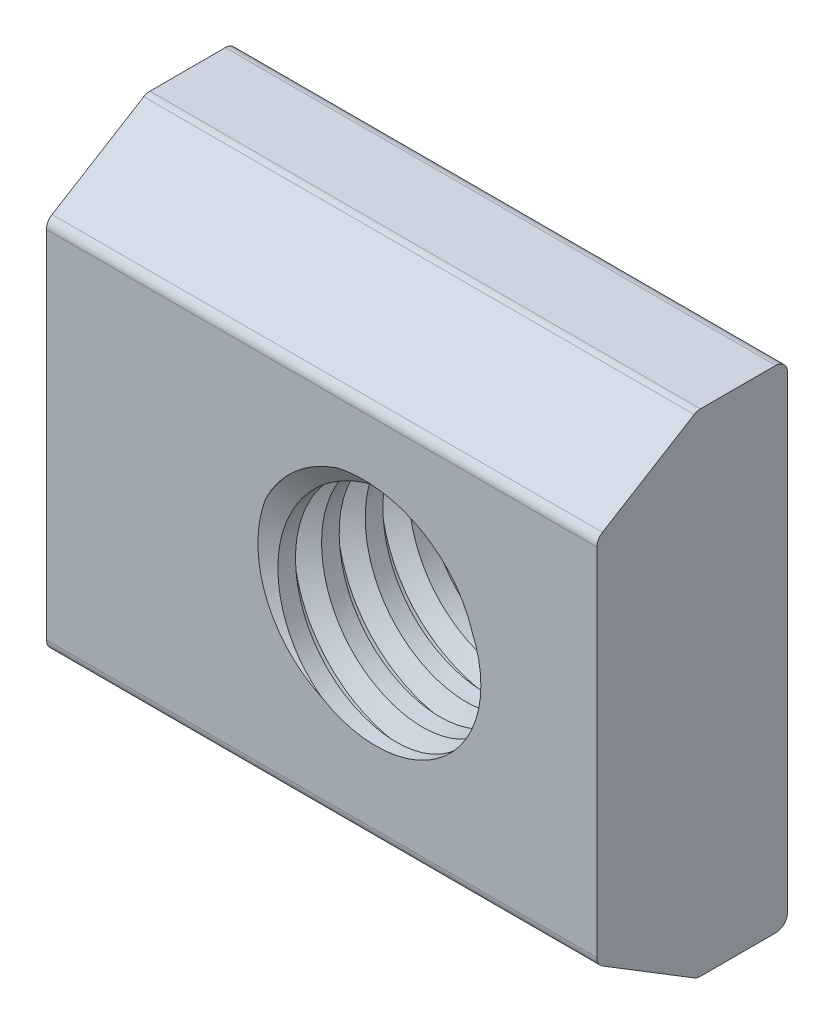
ISO-10303-21;
HEADER;
FILE_DESCRIPTION(('STEP AP214'),'2;1');
FILE_NAME('part.step','',(''),(''),'','','');
FILE_SCHEMA(('AUTOMOTIVE_DESIGN { 1 0 10303 214 1 1 1 1 }'));
ENDSEC;
DATA;
#1=APPLICATION_CONTEXT('core data for automotive mechanical design processes');
#2=APPLICATION_PROTOCOL_DEFINITION('international standard','automotive_design',2000,#1);
#3=PRODUCT_CONTEXT('',#1,'mechanical');
#4=PRODUCT('Part','Part','',(#3));
#5=PRODUCT_RELATED_PRODUCT_CATEGORY('part','',(#4));
#6=PRODUCT_DEFINITION_FORMATION('','',#4);
#7=PRODUCT_DEFINITION_CONTEXT('part definition',#1,'design');
#8=PRODUCT_DEFINITION('design','',#6,#7);
#9=PRODUCT_DEFINITION_SHAPE('','',#8);
#10=(LENGTH_UNIT() NAMED_UNIT(*) SI_UNIT(.MILLI.,.METRE.));
#11=(NAMED_UNIT(*) PLANE_ANGLE_UNIT() SI_UNIT($,.RADIAN.));
#12=(NAMED_UNIT(*) SI_UNIT($,.STERADIAN.) SOLID_ANGLE_UNIT());
#13=UNCERTAINTY_MEASURE_WITH_UNIT(LENGTH_MEASURE(1.E-05),#10,'distance_accuracy_value','');
#14=(GEOMETRIC_REPRESENTATION_CONTEXT(3) GLOBAL_UNCERTAINTY_ASSIGNED_CONTEXT((#13)) GLOBAL_UNIT_ASSIGNED_CONTEXT((#10,
#11,#12)) REPRESENTATION_CONTEXT('',''));
#15=CARTESIAN_POINT('',(0.,0.,0.));
#16=DIRECTION('',(0.,0.,1.));
#17=DIRECTION('',(1.,0.,0.));
#18=AXIS2_PLACEMENT_3D('',#15,#16,#17);
#19=CARTESIAN_POINT('',(8.89,7.5565,0.));
#20=DIRECTION('',(0.,0.,1.));
#21=DIRECTION('',(1.,0.,0.));
#22=AXIS2_PLACEMENT_3D('',#19,#20,#21);
#23=PLANE('',#22);
#24=DIRECTION('',(0.,1.,0.));
#25=VECTOR('',#24,1.);
#26=CARTESIAN_POINT('',(-8.89,7.5565,0.));
#27=LINE('',#26,#25);
#28=CARTESIAN_POINT('',(-8.89,-7.5565,0.));
#29=VERTEX_POINT('',#28);
#30=CARTESIAN_POINT('',(-8.89,7.5565,0.));
#31=VERTEX_POINT('',#30);
#32=EDGE_CURVE('E589',#29,#31,#27,.T.);
#33=ORIENTED_EDGE('',*,*,#32,.T.);
#34=DIRECTION('',(-1.,0.,0.));
#35=VECTOR('',#34,1.);
#36=CARTESIAN_POINT('',(8.89,7.5565,0.));
#37=LINE('',#36,#35);
#38=CARTESIAN_POINT('',(8.89,7.5565,0.));
#39=VERTEX_POINT('',#38);
#40=EDGE_CURVE('E645',#39,#31,#37,.T.);
#41=ORIENTED_EDGE('',*,*,#40,.F.);
#42=DIRECTION('',(0.,1.,0.));
#43=VECTOR('',#42,1.);
#44=CARTESIAN_POINT('',(8.89,7.5565,0.));
#45=LINE('',#44,#43);
#46=CARTESIAN_POINT('',(8.89,-7.5565,0.));
#47=VERTEX_POINT('',#46);
#48=EDGE_CURVE('E613',#47,#39,#45,.T.);
#49=ORIENTED_EDGE('',*,*,#48,.F.);
#50=DIRECTION('',(-1.,0.,0.));
#51=VECTOR('',#50,1.);
#52=CARTESIAN_POINT('',(8.89,-7.5565,0.));
#53=LINE('',#52,#51);
#54=EDGE_CURVE('E648',#47,#29,#53,.T.);
#55=ORIENTED_EDGE('',*,*,#54,.T.);
#56=EDGE_LOOP('',(#33,#41,#49,#55));
#57=FACE_BOUND('',#56,.T.);
#58=CARTESIAN_POINT('',(0.7588526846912,3.24201620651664,0.));
#59=CARTESIAN_POINT('',(0.848695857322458,3.28126761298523,0.));
#60=CARTESIAN_POINT('',(0.940200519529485,3.31671156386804,0.));
#61=CARTESIAN_POINT('',(1.12586585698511,3.37977371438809,0.));
#62=CARTESIAN_POINT('',(1.22002647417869,3.40739208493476,0.));
#63=CARTESIAN_POINT('',(1.41034163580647,3.45459419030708,0.));
#64=CARTESIAN_POINT('',(1.50649619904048,3.47417784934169,0.));
#65=CARTESIAN_POINT('',(1.70010994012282,3.50517453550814,0.));
#66=CARTESIAN_POINT('',(1.79756907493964,3.51658783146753,0.));
#67=CARTESIAN_POINT('',(1.99314585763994,3.53116908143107,0.));
#68=CARTESIAN_POINT('',(2.09126377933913,3.53433336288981,0.));
#69=CARTESIAN_POINT('',(2.28741764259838,3.5323889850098,0.));
#70=CARTESIAN_POINT('',(2.38545358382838,3.52728029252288,0.));
#71=CARTESIAN_POINT('',(2.58066044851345,3.50884010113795,0.));
#72=CARTESIAN_POINT('',(2.67783207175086,3.49551601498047,0.));
#73=CARTESIAN_POINT('',(2.8707010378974,3.46075888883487,0.));
#74=CARTESIAN_POINT('',(2.96639852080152,3.43932662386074,0.));
#75=CARTESIAN_POINT('',(3.15570285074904,3.38849027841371,0.));
#76=CARTESIAN_POINT('',(3.24930891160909,3.35908325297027,0.));
#77=CARTESIAN_POINT('',(3.38760795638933,3.30919147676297,0.));
#78=CARTESIAN_POINT('',(3.43336215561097,3.291594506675,0.));
#79=CARTESIAN_POINT('',(3.52408423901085,3.25446924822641,0.));
#80=CARTESIAN_POINT('',(3.56905210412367,3.23494091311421,0.));
#81=CARTESIAN_POINT('',(3.65822623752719,3.19410052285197,0.));
#82=CARTESIAN_POINT('',(3.70243163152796,3.17278656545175,0.));
#83=CARTESIAN_POINT('',(3.79001746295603,3.12853163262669,0.));
#84=CARTESIAN_POINT('',(3.83339789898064,3.10559065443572,0.));
#85=CARTESIAN_POINT('',(3.96219400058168,3.03433104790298,0.));
#86=CARTESIAN_POINT('',(4.04627551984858,2.98357067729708,0.));
#87=CARTESIAN_POINT('',(4.21499098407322,2.87282673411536,0.));
#88=CARTESIAN_POINT('',(4.29938918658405,2.81248465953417,0.));
#89=CARTESIAN_POINT('',(4.4631118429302,2.68526245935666,0.));
#90=CARTESIAN_POINT('',(4.54243613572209,2.61838212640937,0.));
#91=CARTESIAN_POINT('',(4.69539403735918,2.47860697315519,0.));
#92=CARTESIAN_POINT('',(4.76903536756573,2.40572060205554,0.));
#93=CARTESIAN_POINT('',(4.91028357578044,2.25431352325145,0.));
#94=CARTESIAN_POINT('',(4.97789016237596,2.17579254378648,0.));
#95=CARTESIAN_POINT('',(5.1116610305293,2.00728068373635,0.));
#96=CARTESIAN_POINT('',(5.17730100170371,1.91687290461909,0.));
#97=CARTESIAN_POINT('',(5.30052292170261,1.73086844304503,0.));
#98=CARTESIAN_POINT('',(5.35811374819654,1.63527764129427,0.));
#99=CARTESIAN_POINT('',(5.41148210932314,1.53738683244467,0.));
#100=B_SPLINE_CURVE_WITH_KNOTS('',3,(#58,#59,#60,#61,#62,#63,#64,#65,#66,#67,#68,#69,#70,#71,
#72,#73,#74,#75,#76,#77,#78,#79,#80,#81,#82,#83,#84,#85,#86,#87,#88,#89,#90,#91,#92,#93,#94,#95,
#96,#97,#98,#99),.UNSPECIFIED.,.F.,.F.,(4,2,2,2,2,2,2,2,2,2,2,2,2,2,2,2,2,2,2,2,4),(0.,
0.294040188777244,0.588073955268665,0.882110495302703,1.17613736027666,1.47029510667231,
1.7644540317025,2.05834792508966,2.35221373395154,2.64618821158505,2.79321619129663,
2.94024773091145,3.08743794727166,3.23462841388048,3.52897293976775,3.83990000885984,
4.15083694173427,4.46134368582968,4.77186541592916,5.10662058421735,5.44100357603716),.UNSPECIFIED.);
#101=CARTESIAN_POINT('',(0.7588526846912,3.24201620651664,0.));
#102=VERTEX_POINT('',#101);
#103=CARTESIAN_POINT('',(5.41148210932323,1.53738683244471,0.));
#104=VERTEX_POINT('',#103);
#105=EDGE_CURVE('E477',#102,#104,#100,.T.);
#106=ORIENTED_EDGE('',*,*,#105,.F.);
#107=CARTESIAN_POINT('',(1.7526,0.,0.));
#108=DIRECTION('',(0.,0.,-1.));
#109=DIRECTION('',(-1.,0.,0.));
#110=AXIS2_PLACEMENT_3D('',#107,#108,#109);
#111=CIRCLE('',#110,3.3909);
#112=CARTESIAN_POINT('',(0.758852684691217,-3.24201620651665,0.));
#113=VERTEX_POINT('',#112);
#114=EDGE_CURVE('E376',#113,#102,#111,.T.);
#115=ORIENTED_EDGE('',*,*,#114,.F.);
#116=CARTESIAN_POINT('',(5.41148210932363,-1.53738683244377,0.));
#117=CARTESIAN_POINT('',(5.3590772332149,-1.63350762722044,0.));
#118=CARTESIAN_POINT('',(5.30260467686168,-1.72740857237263,0.));
#119=CARTESIAN_POINT('',(5.18196072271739,-1.91013873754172,0.));
#120=CARTESIAN_POINT('',(5.11778867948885,-1.9989675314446,0.));
#121=CARTESIAN_POINT('',(4.98207150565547,-2.17105681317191,0.));
#122=CARTESIAN_POINT('',(4.91051355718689,-2.25430719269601,0.));
#123=CARTESIAN_POINT('',(4.760632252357,-2.4144744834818,0.));
#124=CARTESIAN_POINT('',(4.68230906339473,-2.49139155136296,0.));
#125=CARTESIAN_POINT('',(4.51950140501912,-2.63830584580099,0.));
#126=CARTESIAN_POINT('',(4.43502019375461,-2.70830668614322,0.));
#127=CARTESIAN_POINT('',(4.26043180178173,-2.84096122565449,0.));
#128=CARTESIAN_POINT('',(4.17032360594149,-2.90361359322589,0.));
#129=CARTESIAN_POINT('',(4.03151062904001,-2.99169516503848,0.));
#130=CARTESIAN_POINT('',(3.98464664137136,-3.02006478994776,0.));
#131=CARTESIAN_POINT('',(3.8897626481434,-3.07481037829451,0.));
#132=CARTESIAN_POINT('',(3.84174261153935,-3.10118628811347,0.));
#133=CARTESIAN_POINT('',(3.74464232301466,-3.15188662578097,0.));
#134=CARTESIAN_POINT('',(3.69556226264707,-3.17621142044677,0.));
#135=CARTESIAN_POINT('',(3.62121545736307,-3.21114386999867,0.));
#136=CARTESIAN_POINT('',(3.59631206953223,-3.22252889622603,0.));
#137=CARTESIAN_POINT('',(3.54624317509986,-3.24470785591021,0.));
#138=CARTESIAN_POINT('',(3.52107765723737,-3.25550176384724,0.));
#139=CARTESIAN_POINT('',(3.39510291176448,-3.30779590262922,0.));
#140=CARTESIAN_POINT('',(3.2924239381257,-3.34491570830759,0.));
#141=CARTESIAN_POINT('',(3.08406616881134,-3.40940718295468,0.));
#142=CARTESIAN_POINT('',(2.97838711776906,-3.43677801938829,0.));
#143=CARTESIAN_POINT('',(2.76494899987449,-3.48152867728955,0.));
#144=CARTESIAN_POINT('',(2.65719033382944,-3.49891040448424,0.));
#145=CARTESIAN_POINT('',(2.4404812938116,-3.52352678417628,0.));
#146=CARTESIAN_POINT('',(2.33153053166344,-3.53075802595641,0.));
#147=CARTESIAN_POINT('',(2.12405705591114,-3.53478624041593,0.));
#148=CARTESIAN_POINT('',(2.02555152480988,-3.53253031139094,0.));
#149=CARTESIAN_POINT('',(1.82908519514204,-3.51969678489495,0.));
#150=CARTESIAN_POINT('',(1.73112436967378,-3.50911960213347,0.));
#151=CARTESIAN_POINT('',(1.53659560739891,-3.47973924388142,0.));
#152=CARTESIAN_POINT('',(1.44002583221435,-3.46094820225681,0.));
#153=CARTESIAN_POINT('',(1.24885420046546,-3.41528182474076,0.));
#154=CARTESIAN_POINT('',(1.15425141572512,-3.38841039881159,0.));
#155=CARTESIAN_POINT('',(1.0097159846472,-3.34067262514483,0.));
#156=CARTESIAN_POINT('',(0.958859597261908,-3.32255477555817,0.));
#157=CARTESIAN_POINT('',(0.85812262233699,-3.28401000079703,0.));
#158=CARTESIAN_POINT('',(0.808240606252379,-3.26358680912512,0.));
#159=CARTESIAN_POINT('',(0.758852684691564,-3.2420162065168,0.));
#160=B_SPLINE_CURVE_WITH_KNOTS('',3,(#116,#117,#118,#119,#120,#121,#122,#123,#124,#125,#126,
#127,#128,#129,#130,#131,#132,#133,#134,#135,#136,#137,#138,#139,#140,#141,#142,#143,#144,#145,
#146,#147,#148,#149,#150,#151,#152,#153,#154,#155,#156,#157,#158,#159),.UNSPECIFIED.,.F.,.F.,(4,
2,2,2,2,2,2,2,2,2,2,2,2,2,2,2,2,2,2,2,2,4),(0.,0.328335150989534,0.65669784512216,
0.985640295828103,1.31457460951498,1.64333613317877,1.97215713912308,2.13646338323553,
2.30077404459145,2.46505525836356,2.54719586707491,2.6293400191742,2.95634956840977,
3.28338703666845,3.61036209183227,3.93744698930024,4.23269550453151,4.52792930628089,
4.82272844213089,5.11738515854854,5.27929541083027,5.44094711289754),.UNSPECIFIED.);
#161=CARTESIAN_POINT('',(5.41148210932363,-1.53738683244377,0.));
#162=VERTEX_POINT('',#161);
#163=EDGE_CURVE('E530',#162,#113,#160,.T.);
#164=ORIENTED_EDGE('',*,*,#163,.F.);
#165=CARTESIAN_POINT('',(1.7526,0.,0.));
#166=DIRECTION('',(0.,0.,1.));
#167=DIRECTION('',(1.,0.,0.));
#168=AXIS2_PLACEMENT_3D('',#165,#166,#167);
#169=CIRCLE('',#168,3.96875);
#170=EDGE_CURVE('E664',#104,#162,#169,.F.);
#171=ORIENTED_EDGE('',*,*,#170,.F.);
#172=EDGE_LOOP('',(#106,#115,#164,#171));
#173=FACE_BOUND('',#172,.T.);
#174=ADVANCED_FACE('F361',(#57,#173),#23,.F.);
#175=CARTESIAN_POINT('',(8.89,-5.74150202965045,6.1595));
#176=DIRECTION('',(0.,0.,-1.));
#177=DIRECTION('',(-1.,0.,0.));
#178=AXIS2_PLACEMENT_3D('',#175,#176,#177);
#179=PLANE('',#178);
#180=DIRECTION('',(0.,-1.,0.));
#181=VECTOR('',#180,1.);
#182=CARTESIAN_POINT('',(-8.89,-5.74150202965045,6.1595));
#183=LINE('',#182,#181);
#184=CARTESIAN_POINT('',(-8.89,5.74150202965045,6.1595));
#185=VERTEX_POINT('',#184);
#186=CARTESIAN_POINT('',(-8.89,-5.74150202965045,6.1595));
#187=VERTEX_POINT('',#186);
#188=EDGE_CURVE('E601',#185,#187,#183,.T.);
#189=ORIENTED_EDGE('',*,*,#188,.T.);
#190=DIRECTION('',(-1.,0.,0.));
#191=VECTOR('',#190,1.);
#192=CARTESIAN_POINT('',(8.89,-5.74150202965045,6.1595));
#193=LINE('',#192,#191);
#194=CARTESIAN_POINT('',(8.89,-5.74150202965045,6.1595));
#195=VERTEX_POINT('',#194);
#196=EDGE_CURVE('E627',#195,#187,#193,.T.);
#197=ORIENTED_EDGE('',*,*,#196,.F.);
#198=DIRECTION('',(0.,-1.,0.));
#199=VECTOR('',#198,1.);
#200=CARTESIAN_POINT('',(8.89,-5.74150202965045,6.1595));
#201=LINE('',#200,#199);
#202=CARTESIAN_POINT('',(8.89,5.74150202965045,6.1595));
#203=VERTEX_POINT('',#202);
#204=EDGE_CURVE('E625',#203,#195,#201,.T.);
#205=ORIENTED_EDGE('',*,*,#204,.F.);
#206=DIRECTION('',(-1.,0.,0.));
#207=VECTOR('',#206,1.);
#208=CARTESIAN_POINT('',(8.89,5.74150202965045,6.1595));
#209=LINE('',#208,#207);
#210=EDGE_CURVE('E630',#203,#185,#209,.T.);
#211=ORIENTED_EDGE('',*,*,#210,.T.);
#212=EDGE_LOOP('',(#189,#197,#205,#211));
#213=FACE_BOUND('',#212,.T.);
#214=CARTESIAN_POINT('',(4.84830577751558,1.38376607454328,6.1595));
#215=CARTESIAN_POINT('',(4.81980656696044,1.47546963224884,6.1595));
#216=CARTESIAN_POINT('',(4.78741261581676,1.5659605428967,6.1595));
#217=CARTESIAN_POINT('',(4.71511804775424,1.74387437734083,6.1595));
#218=CARTESIAN_POINT('',(4.67521873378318,1.8312978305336,6.1595));
#219=CARTESIAN_POINT('',(4.58832251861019,2.00219815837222,6.1595));
#220=CARTESIAN_POINT('',(4.54134824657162,2.08568653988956,6.1595));
#221=CARTESIAN_POINT('',(4.44054821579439,2.24842678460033,6.1595));
#222=CARTESIAN_POINT('',(4.38672198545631,2.32767835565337,6.1595));
#223=CARTESIAN_POINT('',(4.27253311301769,2.4814798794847,6.1595));
#224=CARTESIAN_POINT('',(4.21216231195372,2.55602377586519,6.1595));
#225=CARTESIAN_POINT('',(4.08538565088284,2.6997673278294,6.1595));
#226=CARTESIAN_POINT('',(4.01898059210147,2.76896769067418,6.1595));
#227=CARTESIAN_POINT('',(3.88056257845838,2.9015884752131,6.1595));
#228=CARTESIAN_POINT('',(3.808547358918,2.96500654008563,6.1595));
#229=CARTESIAN_POINT('',(3.69674548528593,3.05543329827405,6.1595));
#230=CARTESIAN_POINT('',(3.65884156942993,3.08479676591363,6.1595));
#231=CARTESIAN_POINT('',(3.58183308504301,3.14190626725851,6.1595));
#232=CARTESIAN_POINT('',(3.54272845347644,3.16965221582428,6.1595));
#233=CARTESIAN_POINT('',(3.42333505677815,3.25107037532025,6.1595));
#234=CARTESIAN_POINT('',(3.34149981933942,3.30249796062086,6.1595));
#235=CARTESIAN_POINT('',(3.17417505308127,3.39898897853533,6.1595));
#236=CARTESIAN_POINT('',(3.08868569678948,3.44405271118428,6.1595));
#237=CARTESIAN_POINT('',(2.91448232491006,3.52760869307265,6.1595));
#238=CARTESIAN_POINT('',(2.82576642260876,3.56609701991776,6.1595));
#239=CARTESIAN_POINT('',(2.64569469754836,3.63623400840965,6.1595));
#240=CARTESIAN_POINT('',(2.55433881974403,3.66788252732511,6.1595));
#241=CARTESIAN_POINT('',(2.25626300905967,3.7586029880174,6.1595));
#242=CARTESIAN_POINT('',(2.04514689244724,3.803852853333,6.1595));
#243=CARTESIAN_POINT('',(1.6185206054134,3.85813356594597,6.1595));
#244=CARTESIAN_POINT('',(1.40301435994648,3.86719545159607,6.1595));
#245=CARTESIAN_POINT('',(1.07258689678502,3.8532587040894,6.1595));
#246=CARTESIAN_POINT('',(0.957000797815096,3.84309116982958,6.1595));
#247=CARTESIAN_POINT('',(0.727408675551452,3.81234092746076,6.1595));
#248=CARTESIAN_POINT('',(0.613400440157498,3.79177473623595,6.1595));
#249=CARTESIAN_POINT('',(0.500512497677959,3.76606604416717,6.1595));
#250=B_SPLINE_CURVE_WITH_KNOTS('',3,(#214,#215,#216,#217,#218,#219,#220,#221,#222,#223,#224,
#225,#226,#227,#228,#229,#230,#231,#232,#233,#234,#235,#236,#237,#238,#239,#240,#241,#242,#243,
#244,#245,#246,#247,#248,#249),.UNSPECIFIED.,.F.,.F.,(4,2,2,2,2,2,2,2,2,2,2,2,2,2,2,2,2,4),(0.,
0.288001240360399,0.57595252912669,0.863001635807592,1.15007050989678,1.43750147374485,
1.72489432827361,2.01240380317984,2.15620757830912,2.3000189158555,2.58968140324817,
2.87933022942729,3.16915123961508,3.45897829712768,4.1033989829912,4.74726683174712,
5.09493497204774,5.44205261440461),.UNSPECIFIED.);
#251=CARTESIAN_POINT('',(4.84830577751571,1.38376607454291,6.1595));
#252=VERTEX_POINT('',#251);
#253=CARTESIAN_POINT('',(0.500512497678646,3.7660660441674,6.15949999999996));
#254=VERTEX_POINT('',#253);
#255=EDGE_CURVE('E369',#252,#254,#250,.T.);
#256=ORIENTED_EDGE('',*,*,#255,.F.);
#257=CARTESIAN_POINT('',(1.7526,0.,6.1595));
#258=DIRECTION('',(0.,0.,-1.));
#259=DIRECTION('',(-1.,0.,0.));
#260=AXIS2_PLACEMENT_3D('',#257,#258,#259);
#261=CIRCLE('',#260,3.3909);
#262=CARTESIAN_POINT('',(0.000359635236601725,-2.90307707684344,6.1595));
#263=VERTEX_POINT('',#262);
#264=EDGE_CURVE('E474',#263,#252,#261,.F.);
#265=ORIENTED_EDGE('',*,*,#264,.F.);
#266=CARTESIAN_POINT('',(-1.80529717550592,1.75850625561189,6.15949999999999));
#267=CARTESIAN_POINT('',(-1.8442862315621,1.65399620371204,6.1595));
#268=CARTESIAN_POINT('',(-1.87885307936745,1.54783912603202,6.1595));
#269=CARTESIAN_POINT('',(-1.9389356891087,1.33303899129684,6.1595));
#270=CARTESIAN_POINT('',(-1.96445503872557,1.22439693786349,6.1595));
#271=CARTESIAN_POINT('',(-2.00635119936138,1.00491091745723,6.1595));
#272=CARTESIAN_POINT('',(-2.02269088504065,0.894059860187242,6.1595));
#273=CARTESIAN_POINT('',(-2.04597481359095,0.671352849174,6.1595));
#274=CARTESIAN_POINT('',(-2.05291693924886,0.559496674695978,6.15949999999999));
#275=CARTESIAN_POINT('',(-2.05731685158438,0.33543781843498,6.15949999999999));
#276=CARTESIAN_POINT('',(-2.0547620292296,0.223234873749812,6.1595));
#277=CARTESIAN_POINT('',(-2.04393304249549,0.0554187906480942,6.1595));
#278=CARTESIAN_POINT('',(-2.03915700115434,-0.000440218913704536,6.1595));
#279=CARTESIAN_POINT('',(-2.02700624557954,-0.111878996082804,6.1595));
#280=CARTESIAN_POINT('',(-2.01963166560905,-0.167458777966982,6.1595));
#281=CARTESIAN_POINT('',(-2.0022958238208,-0.27810209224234,6.1595));
#282=CARTESIAN_POINT('',(-1.99233959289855,-0.333166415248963,6.1595));
#283=CARTESIAN_POINT('',(-1.96985920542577,-0.442766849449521,6.1595));
#284=CARTESIAN_POINT('',(-1.95733505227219,-0.497302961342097,6.1595));
#285=CARTESIAN_POINT('',(-1.91595262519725,-0.659927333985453,6.1595));
#286=CARTESIAN_POINT('',(-1.88328063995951,-0.767055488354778,6.1595));
#287=CARTESIAN_POINT('',(-1.77546007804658,-1.06887840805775,6.1595));
#288=CARTESIAN_POINT('',(-1.68799279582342,-1.25931889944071,6.1595));
#289=CARTESIAN_POINT('',(-1.48107371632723,-1.62209396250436,6.1595));
#290=CARTESIAN_POINT('',(-1.3615916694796,-1.7944111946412,6.1595));
#291=CARTESIAN_POINT('',(-1.09951453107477,-2.10931579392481,6.1595));
#292=CARTESIAN_POINT('',(-0.95798281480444,-2.25279051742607,6.1595));
#293=CARTESIAN_POINT('',(-0.652961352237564,-2.51369920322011,6.1595));
#294=CARTESIAN_POINT('',(-0.489514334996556,-2.63118268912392,6.1595));
#295=CARTESIAN_POINT('',(-0.266044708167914,-2.76487542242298,6.1595));
#296=CARTESIAN_POINT('',(-0.21370207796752,-2.79441576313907,6.1595));
#297=CARTESIAN_POINT('',(-0.107672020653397,-2.85077822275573,6.1595));
#298=CARTESIAN_POINT('',(-0.0539866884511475,-2.87760428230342,6.15949999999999));
#299=CARTESIAN_POINT('',(0.000359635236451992,-2.90307707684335,6.15949999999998));
#300=B_SPLINE_CURVE_WITH_KNOTS('',3,(#266,#267,#268,#269,#270,#271,#272,#273,#274,#275,#276,
#277,#278,#279,#280,#281,#282,#283,#284,#285,#286,#287,#288,#289,#290,#291,#292,#293,#294,#295,
#296,#297,#298,#299),.UNSPECIFIED.,.F.,.F.,(4,2,2,2,2,2,2,2,2,2,2,2,2,2,2,2,4),(0.,
0.334535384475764,0.668937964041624,1.00468340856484,1.340504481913,1.67677158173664,
1.84491543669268,2.01305060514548,2.18086055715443,2.34867028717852,2.68421760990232,
3.30947504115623,3.93532535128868,4.5371497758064,5.13781741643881,5.31807506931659,
5.49806714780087),.UNSPECIFIED.);
#301=CARTESIAN_POINT('',(-1.80529717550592,1.75850625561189,6.15949999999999));
#302=VERTEX_POINT('',#301);
#303=EDGE_CURVE('E485',#302,#263,#300,.T.);
#304=ORIENTED_EDGE('',*,*,#303,.F.);
#305=CARTESIAN_POINT('',(1.7526,0.,6.1595));
#306=DIRECTION('',(0.,0.,-1.));
#307=DIRECTION('',(-1.,0.,0.));
#308=AXIS2_PLACEMENT_3D('',#305,#306,#307);
#309=CIRCLE('',#308,3.96875);
#310=EDGE_CURVE('E11',#254,#302,#309,.F.);
#311=ORIENTED_EDGE('',*,*,#310,.F.);
#312=EDGE_LOOP('',(#256,#265,#304,#311));
#313=FACE_BOUND('',#312,.T.);
#314=ADVANCED_FACE('F483',(#213,#313),#179,.F.);
#315=CARTESIAN_POINT('',(8.89,-5.74150202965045,5.7785));
#316=DIRECTION('',(-1.,0.,0.));
#317=DIRECTION('',(0.,0.,1.));
#318=AXIS2_PLACEMENT_3D('',#315,#316,#317);
#319=CYLINDRICAL_SURFACE('',#318,0.381);
#320=CARTESIAN_POINT('',(-8.89,-5.74150202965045,5.7785));
#321=DIRECTION('',(1.,0.,0.));
#322=DIRECTION('',(0.,0.,-1.));
#323=AXIS2_PLACEMENT_3D('',#320,#321,#322);
#324=CIRCLE('',#323,0.381);
#325=CARTESIAN_POINT('',(-8.89,-6.06636155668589,5.97756603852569));
#326=VERTEX_POINT('',#325);
#327=EDGE_CURVE('E574',#187,#326,#324,.T.);
#328=ORIENTED_EDGE('',*,*,#327,.T.);
#329=DIRECTION('',(-1.,0.,0.));
#330=VECTOR('',#329,1.);
#331=CARTESIAN_POINT('',(8.89,-6.06636155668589,5.97756603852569));
#332=LINE('',#331,#330);
#333=CARTESIAN_POINT('',(8.89,-6.06636155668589,5.97756603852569));
#334=VERTEX_POINT('',#333);
#335=EDGE_CURVE('E488',#334,#326,#332,.T.);
#336=ORIENTED_EDGE('',*,*,#335,.F.);
#337=CARTESIAN_POINT('',(8.89,-5.74150202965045,5.7785));
#338=DIRECTION('',(1.,0.,0.));
#339=DIRECTION('',(0.,0.,-1.));
#340=AXIS2_PLACEMENT_3D('',#337,#338,#339);
#341=CIRCLE('',#340,0.381);
#342=EDGE_CURVE('E603',#195,#334,#341,.T.);
#343=ORIENTED_EDGE('',*,*,#342,.F.);
#344=ORIENTED_EDGE('',*,*,#196,.T.);
#345=EDGE_LOOP('',(#328,#336,#343,#344));
#346=FACE_BOUND('',#345,.T.);
#347=ADVANCED_FACE('F363',(#346),#319,.T.);
#348=CARTESIAN_POINT('',(8.89,-7.88135952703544,3.01563749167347));
#349=DIRECTION('',(0.,0.852649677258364,-0.522483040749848));
#350=DIRECTION('',(0.,0.522483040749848,0.852649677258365));
#351=AXIS2_PLACEMENT_3D('',#348,#349,#350);
#352=PLANE('',#351);
#353=DIRECTION('',(0.,-0.522483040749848,-0.852649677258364));
#354=VECTOR('',#353,1.);
#355=CARTESIAN_POINT('',(-8.89,-7.88135952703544,3.01563749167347));
#356=LINE('',#355,#354);
#357=CARTESIAN_POINT('',(-8.89,-7.88135952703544,3.01563749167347));
#358=VERTEX_POINT('',#357);
#359=EDGE_CURVE('E565',#326,#358,#356,.T.);
#360=ORIENTED_EDGE('',*,*,#359,.T.);
#361=DIRECTION('',(-1.,0.,0.));
#362=VECTOR('',#361,1.);
#363=CARTESIAN_POINT('',(8.89,-7.88135952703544,3.01563749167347));
#364=LINE('',#363,#362);
#365=CARTESIAN_POINT('',(8.89,-7.88135952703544,3.01563749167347));
#366=VERTEX_POINT('',#365);
#367=EDGE_CURVE('E491',#366,#358,#364,.T.);
#368=ORIENTED_EDGE('',*,*,#367,.F.);
#369=DIRECTION('',(0.,-0.522483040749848,-0.852649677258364));
#370=VECTOR('',#369,1.);
#371=CARTESIAN_POINT('',(8.89,-7.88135952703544,3.01563749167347));
#372=LINE('',#371,#370);
#373=EDGE_CURVE('E606',#334,#366,#372,.T.);
#374=ORIENTED_EDGE('',*,*,#373,.F.);
#375=ORIENTED_EDGE('',*,*,#335,.T.);
#376=EDGE_LOOP('',(#360,#368,#374,#375));
#377=FACE_BOUND('',#376,.T.);
#378=ADVANCED_FACE('F556',(#377),#352,.F.);
#379=CARTESIAN_POINT('',(8.89,-7.5565,2.81657145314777));
#380=DIRECTION('',(-1.,0.,0.));
#381=DIRECTION('',(0.,0.,1.));
#382=AXIS2_PLACEMENT_3D('',#379,#380,#381);
#383=CYLINDRICAL_SURFACE('',#382,0.381);
#384=CARTESIAN_POINT('',(-8.89,-7.5565,2.81657145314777));
#385=DIRECTION('',(1.,0.,0.));
#386=DIRECTION('',(0.,0.,1.));
#387=AXIS2_PLACEMENT_3D('',#384,#385,#386);
#388=CIRCLE('',#387,0.381);
#389=CARTESIAN_POINT('',(-8.89,-7.9375,2.81657145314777));
#390=VERTEX_POINT('',#389);
#391=EDGE_CURVE('E573',#358,#390,#388,.T.);
#392=ORIENTED_EDGE('',*,*,#391,.T.);
#393=DIRECTION('',(-1.,0.,0.));
#394=VECTOR('',#393,1.);
#395=CARTESIAN_POINT('',(8.89,-7.9375,2.81657145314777));
#396=LINE('',#395,#394);
#397=CARTESIAN_POINT('',(8.89,-7.9375,2.81657145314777));
#398=VERTEX_POINT('',#397);
#399=EDGE_CURVE('E579',#398,#390,#396,.T.);
#400=ORIENTED_EDGE('',*,*,#399,.F.);
#401=CARTESIAN_POINT('',(8.89,-7.5565,2.81657145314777));
#402=DIRECTION('',(1.,0.,0.));
#403=DIRECTION('',(0.,0.,1.));
#404=AXIS2_PLACEMENT_3D('',#401,#402,#403);
#405=CIRCLE('',#404,0.381);
#406=EDGE_CURVE('E578',#366,#398,#405,.T.);
#407=ORIENTED_EDGE('',*,*,#406,.F.);
#408=ORIENTED_EDGE('',*,*,#367,.T.);
#409=EDGE_LOOP('',(#392,#400,#407,#408));
#410=FACE_BOUND('',#409,.T.);
#411=ADVANCED_FACE('F553',(#410),#383,.T.);
#412=CARTESIAN_POINT('',(8.89,-7.9375,0.381000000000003));
#413=DIRECTION('',(0.,1.,0.));
#414=DIRECTION('',(0.,0.,1.));
#415=AXIS2_PLACEMENT_3D('',#412,#413,#414);
#416=PLANE('',#415);
#417=DIRECTION('',(0.,0.,-1.));
#418=VECTOR('',#417,1.);
#419=CARTESIAN_POINT('',(-8.89,-7.9375,0.381000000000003));
#420=LINE('',#419,#418);
#421=CARTESIAN_POINT('',(-8.89,-7.9375,0.381000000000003));
#422=VERTEX_POINT('',#421);
#423=EDGE_CURVE('E582',#390,#422,#420,.T.);
#424=ORIENTED_EDGE('',*,*,#423,.T.);
#425=DIRECTION('',(-1.,0.,0.));
#426=VECTOR('',#425,1.);
#427=CARTESIAN_POINT('',(8.89,-7.9375,0.381000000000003));
#428=LINE('',#427,#426);
#429=CARTESIAN_POINT('',(8.89,-7.9375,0.381000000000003));
#430=VERTEX_POINT('',#429);
#431=EDGE_CURVE('E651',#430,#422,#428,.T.);
#432=ORIENTED_EDGE('',*,*,#431,.F.);
#433=DIRECTION('',(0.,0.,-1.));
#434=VECTOR('',#433,1.);
#435=CARTESIAN_POINT('',(8.89,-7.9375,0.381000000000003));
#436=LINE('',#435,#434);
#437=EDGE_CURVE('E609',#398,#430,#436,.T.);
#438=ORIENTED_EDGE('',*,*,#437,.F.);
#439=ORIENTED_EDGE('',*,*,#399,.T.);
#440=EDGE_LOOP('',(#424,#432,#438,#439));
#441=FACE_BOUND('',#440,.T.);
#442=ADVANCED_FACE('F549',(#441),#416,.F.);
#443=CARTESIAN_POINT('',(8.89,-7.5565,0.381));
#444=DIRECTION('',(-1.,0.,0.));
#445=DIRECTION('',(0.,0.,1.));
#446=AXIS2_PLACEMENT_3D('',#443,#444,#445);
#447=CYLINDRICAL_SURFACE('',#446,0.381);
#448=CARTESIAN_POINT('',(-8.89,-7.5565,0.381));
#449=DIRECTION('',(1.,0.,0.));
#450=DIRECTION('',(0.,0.,1.));
#451=AXIS2_PLACEMENT_3D('',#448,#449,#450);
#452=CIRCLE('',#451,0.381);
#453=EDGE_CURVE('E584',#422,#29,#452,.T.);
#454=ORIENTED_EDGE('',*,*,#453,.T.);
#455=ORIENTED_EDGE('',*,*,#54,.F.);
#456=CARTESIAN_POINT('',(8.89,-7.5565,0.381));
#457=DIRECTION('',(1.,0.,0.));
#458=DIRECTION('',(0.,0.,1.));
#459=AXIS2_PLACEMENT_3D('',#456,#457,#458);
#460=CIRCLE('',#459,0.381);
#461=EDGE_CURVE('E611',#430,#47,#460,.T.);
#462=ORIENTED_EDGE('',*,*,#461,.F.);
#463=ORIENTED_EDGE('',*,*,#431,.T.);
#464=EDGE_LOOP('',(#454,#455,#462,#463));
#465=FACE_BOUND('',#464,.T.);
#466=ADVANCED_FACE('F545',(#465),#447,.T.);
#467=CARTESIAN_POINT('',(8.89,7.5565,0.381));
#468=DIRECTION('',(-1.,0.,0.));
#469=DIRECTION('',(0.,0.,1.));
#470=AXIS2_PLACEMENT_3D('',#467,#468,#469);
#471=CYLINDRICAL_SURFACE('',#470,0.381);
#472=CARTESIAN_POINT('',(-8.89,7.5565,0.381));
#473=DIRECTION('',(1.,0.,0.));
#474=DIRECTION('',(0.,0.,-1.));
#475=AXIS2_PLACEMENT_3D('',#472,#473,#474);
#476=CIRCLE('',#475,0.381);
#477=CARTESIAN_POINT('',(-8.89,7.9375,0.381000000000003));
#478=VERTEX_POINT('',#477);
#479=EDGE_CURVE('E591',#31,#478,#476,.T.);
#480=ORIENTED_EDGE('',*,*,#479,.T.);
#481=DIRECTION('',(-1.,0.,0.));
#482=VECTOR('',#481,1.);
#483=CARTESIAN_POINT('',(8.89,7.9375,0.381000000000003));
#484=LINE('',#483,#482);
#485=CARTESIAN_POINT('',(8.89,7.9375,0.381000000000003));
#486=VERTEX_POINT('',#485);
#487=EDGE_CURVE('E642',#486,#478,#484,.T.);
#488=ORIENTED_EDGE('',*,*,#487,.F.);
#489=CARTESIAN_POINT('',(8.89,7.5565,0.381));
#490=DIRECTION('',(1.,0.,0.));
#491=DIRECTION('',(0.,0.,-1.));
#492=AXIS2_PLACEMENT_3D('',#489,#490,#491);
#493=CIRCLE('',#492,0.381);
#494=EDGE_CURVE('E615',#39,#486,#493,.T.);
#495=ORIENTED_EDGE('',*,*,#494,.F.);
#496=ORIENTED_EDGE('',*,*,#40,.T.);
#497=EDGE_LOOP('',(#480,#488,#495,#496));
#498=FACE_BOUND('',#497,.T.);
#499=ADVANCED_FACE('F543',(#498),#471,.T.);
#500=CARTESIAN_POINT('',(8.89,7.9375,0.381000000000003));
#501=DIRECTION('',(0.,-1.,0.));
#502=DIRECTION('',(0.,0.,-1.));
#503=AXIS2_PLACEMENT_3D('',#500,#501,#502);
#504=PLANE('',#503);
#505=DIRECTION('',(0.,0.,1.));
#506=VECTOR('',#505,1.);
#507=CARTESIAN_POINT('',(-8.89,7.9375,0.381000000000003));
#508=LINE('',#507,#506);
#509=CARTESIAN_POINT('',(-8.89,7.9375,2.81657145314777));
#510=VERTEX_POINT('',#509);
#511=EDGE_CURVE('E593',#478,#510,#508,.T.);
#512=ORIENTED_EDGE('',*,*,#511,.T.);
#513=DIRECTION('',(-1.,0.,0.));
#514=VECTOR('',#513,1.);
#515=CARTESIAN_POINT('',(8.89,7.9375,2.81657145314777));
#516=LINE('',#515,#514);
#517=CARTESIAN_POINT('',(8.89,7.9375,2.81657145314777));
#518=VERTEX_POINT('',#517);
#519=EDGE_CURVE('E639',#518,#510,#516,.T.);
#520=ORIENTED_EDGE('',*,*,#519,.F.);
#521=DIRECTION('',(0.,0.,1.));
#522=VECTOR('',#521,1.);
#523=CARTESIAN_POINT('',(8.89,7.9375,0.381000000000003));
#524=LINE('',#523,#522);
#525=EDGE_CURVE('E617',#486,#518,#524,.T.);
#526=ORIENTED_EDGE('',*,*,#525,.F.);
#527=ORIENTED_EDGE('',*,*,#487,.T.);
#528=EDGE_LOOP('',(#512,#520,#526,#527));
#529=FACE_BOUND('',#528,.T.);
#530=ADVANCED_FACE('F757',(#529),#504,.F.);
#531=CARTESIAN_POINT('',(8.89,7.5565,2.81657145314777));
#532=DIRECTION('',(-1.,0.,0.));
#533=DIRECTION('',(0.,0.,1.));
#534=AXIS2_PLACEMENT_3D('',#531,#532,#533);
#535=CYLINDRICAL_SURFACE('',#534,0.381000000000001);
#536=CARTESIAN_POINT('',(-8.89,7.5565,2.81657145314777));
#537=DIRECTION('',(1.,0.,0.));
#538=DIRECTION('',(0.,0.,-1.));
#539=AXIS2_PLACEMENT_3D('',#536,#537,#538);
#540=CIRCLE('',#539,0.381000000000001);
#541=CARTESIAN_POINT('',(-8.89,7.88135952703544,3.01563749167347));
#542=VERTEX_POINT('',#541);
#543=EDGE_CURVE('E595',#510,#542,#540,.T.);
#544=ORIENTED_EDGE('',*,*,#543,.T.);
#545=DIRECTION('',(-1.,0.,0.));
#546=VECTOR('',#545,1.);
#547=CARTESIAN_POINT('',(8.89,7.88135952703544,3.01563749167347));
#548=LINE('',#547,#546);
#549=CARTESIAN_POINT('',(8.89,7.88135952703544,3.01563749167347));
#550=VERTEX_POINT('',#549);
#551=EDGE_CURVE('E636',#550,#542,#548,.T.);
#552=ORIENTED_EDGE('',*,*,#551,.F.);
#553=CARTESIAN_POINT('',(8.89,7.5565,2.81657145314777));
#554=DIRECTION('',(1.,0.,0.));
#555=DIRECTION('',(0.,0.,-1.));
#556=AXIS2_PLACEMENT_3D('',#553,#554,#555);
#557=CIRCLE('',#556,0.381000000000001);
#558=EDGE_CURVE('E619',#518,#550,#557,.T.);
#559=ORIENTED_EDGE('',*,*,#558,.F.);
#560=ORIENTED_EDGE('',*,*,#519,.T.);
#561=EDGE_LOOP('',(#544,#552,#559,#560));
#562=FACE_BOUND('',#561,.T.);
#563=ADVANCED_FACE('F749',(#562),#535,.T.);
#564=CARTESIAN_POINT('',(8.89,6.06636155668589,5.97756603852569));
#565=DIRECTION('',(0.,-0.852649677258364,-0.522483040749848));
#566=DIRECTION('',(0.,0.522483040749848,-0.852649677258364));
#567=AXIS2_PLACEMENT_3D('',#564,#565,#566);
#568=PLANE('',#567);
#569=DIRECTION('',(0.,-0.522483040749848,0.852649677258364));
#570=VECTOR('',#569,1.);
#571=CARTESIAN_POINT('',(-8.89,6.06636155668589,5.97756603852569));
#572=LINE('',#571,#570);
#573=CARTESIAN_POINT('',(-8.89,6.06636155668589,5.97756603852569));
#574=VERTEX_POINT('',#573);
#575=EDGE_CURVE('E597',#542,#574,#572,.T.);
#576=ORIENTED_EDGE('',*,*,#575,.T.);
#577=DIRECTION('',(-1.,0.,0.));
#578=VECTOR('',#577,1.);
#579=CARTESIAN_POINT('',(8.89,6.06636155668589,5.97756603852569));
#580=LINE('',#579,#578);
#581=CARTESIAN_POINT('',(8.89,6.06636155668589,5.97756603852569));
#582=VERTEX_POINT('',#581);
#583=EDGE_CURVE('E633',#582,#574,#580,.T.);
#584=ORIENTED_EDGE('',*,*,#583,.F.);
#585=DIRECTION('',(0.,-0.522483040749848,0.852649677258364));
#586=VECTOR('',#585,1.);
#587=CARTESIAN_POINT('',(8.89,6.06636155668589,5.97756603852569));
#588=LINE('',#587,#586);
#589=EDGE_CURVE('E621',#550,#582,#588,.T.);
#590=ORIENTED_EDGE('',*,*,#589,.F.);
#591=ORIENTED_EDGE('',*,*,#551,.T.);
#592=EDGE_LOOP('',(#576,#584,#590,#591));
#593=FACE_BOUND('',#592,.T.);
#594=ADVANCED_FACE('F742',(#593),#568,.F.);
#595=CARTESIAN_POINT('',(8.89,5.74150202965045,5.7785));
#596=DIRECTION('',(-1.,0.,0.));
#597=DIRECTION('',(0.,0.,1.));
#598=AXIS2_PLACEMENT_3D('',#595,#596,#597);
#599=CYLINDRICAL_SURFACE('',#598,0.381);
#600=CARTESIAN_POINT('',(-8.89,5.74150202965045,5.7785));
#601=DIRECTION('',(1.,0.,0.));
#602=DIRECTION('',(0.,0.,-1.));
#603=AXIS2_PLACEMENT_3D('',#600,#601,#602);
#604=CIRCLE('',#603,0.381);
#605=EDGE_CURVE('E599',#574,#185,#604,.T.);
#606=ORIENTED_EDGE('',*,*,#605,.T.);
#607=ORIENTED_EDGE('',*,*,#210,.F.);
#608=CARTESIAN_POINT('',(8.89,5.74150202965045,5.7785));
#609=DIRECTION('',(1.,0.,0.));
#610=DIRECTION('',(0.,0.,-1.));
#611=AXIS2_PLACEMENT_3D('',#608,#609,#610);
#612=CIRCLE('',#611,0.381);
#613=EDGE_CURVE('E623',#582,#203,#612,.T.);
#614=ORIENTED_EDGE('',*,*,#613,.F.);
#615=ORIENTED_EDGE('',*,*,#583,.T.);
#616=EDGE_LOOP('',(#606,#607,#614,#615));
#617=FACE_BOUND('',#616,.T.);
#618=ADVANCED_FACE('F736',(#617),#599,.T.);
#619=CARTESIAN_POINT('',(8.89,-5.74150202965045,5.7785));
#620=DIRECTION('',(1.,0.,0.));
#621=DIRECTION('',(0.,0.,-1.));
#622=AXIS2_PLACEMENT_3D('',#619,#620,#621);
#623=PLANE('',#622);
#624=ORIENTED_EDGE('',*,*,#342,.T.);
#625=ORIENTED_EDGE('',*,*,#373,.T.);
#626=ORIENTED_EDGE('',*,*,#406,.T.);
#627=ORIENTED_EDGE('',*,*,#437,.T.);
#628=ORIENTED_EDGE('',*,*,#461,.T.);
#629=ORIENTED_EDGE('',*,*,#48,.T.);
#630=ORIENTED_EDGE('',*,*,#494,.T.);
#631=ORIENTED_EDGE('',*,*,#525,.T.);
#632=ORIENTED_EDGE('',*,*,#558,.T.);
#633=ORIENTED_EDGE('',*,*,#589,.T.);
#634=ORIENTED_EDGE('',*,*,#613,.T.);
#635=ORIENTED_EDGE('',*,*,#204,.T.);
#636=EDGE_LOOP('',(#624,#625,#626,#627,#628,#629,#630,#631,#632,#633,#634,#635));
#637=FACE_BOUND('',#636,.T.);
#638=ADVANCED_FACE('F658',(#637),#623,.T.);
#639=CARTESIAN_POINT('',(-8.89,-5.74150202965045,5.7785));
#640=DIRECTION('',(1.,0.,0.));
#641=DIRECTION('',(0.,0.,-1.));
#642=AXIS2_PLACEMENT_3D('',#639,#640,#641);
#643=PLANE('',#642);
#644=ORIENTED_EDGE('',*,*,#327,.F.);
#645=ORIENTED_EDGE('',*,*,#188,.F.);
#646=ORIENTED_EDGE('',*,*,#605,.F.);
#647=ORIENTED_EDGE('',*,*,#575,.F.);
#648=ORIENTED_EDGE('',*,*,#543,.F.);
#649=ORIENTED_EDGE('',*,*,#511,.F.);
#650=ORIENTED_EDGE('',*,*,#479,.F.);
#651=ORIENTED_EDGE('',*,*,#32,.F.);
#652=ORIENTED_EDGE('',*,*,#453,.F.);
#653=ORIENTED_EDGE('',*,*,#423,.F.);
#654=ORIENTED_EDGE('',*,*,#391,.F.);
#655=ORIENTED_EDGE('',*,*,#359,.F.);
#656=EDGE_LOOP('',(#644,#645,#646,#647,#648,#649,#650,#651,#652,#653,#654,#655));
#657=FACE_BOUND('',#656,.T.);
#658=ADVANCED_FACE('F516',(#657),#643,.F.);
#659=CARTESIAN_POINT('',(1.7526,0.,0.));
#660=DIRECTION('',(0.,0.,1.));
#661=DIRECTION('',(1.,0.,0.));
#662=AXIS2_PLACEMENT_3D('',#659,#660,#661);
#663=CYLINDRICAL_SURFACE('',#662,3.96875);
#664=ORIENTED_EDGE('',*,*,#170,.T.);
#665=CARTESIAN_POINT('',(-2.21615,0.,-0.617475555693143));
#666=CARTESIAN_POINT('',(-2.21615,-2.29135888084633,-0.499882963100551));
#667=CARTESIAN_POINT('',(-0.231775,-3.43703832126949,-0.382290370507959));
#668=CARTESIAN_POINT('',(1.7526,-4.58271776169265,-0.264697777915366));
#669=CARTESIAN_POINT('',(3.736975,-3.43703832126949,-0.147105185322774));
#670=CARTESIAN_POINT('',(5.72135,-2.29135888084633,-0.0295125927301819));
#671=CARTESIAN_POINT('',(5.72135,0.,0.0880799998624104));
#672=CARTESIAN_POINT('',(5.72135,2.29135888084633,0.205672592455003));
#673=CARTESIAN_POINT('',(3.736975,3.43703832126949,0.323265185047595));
#674=CARTESIAN_POINT('',(1.7526,4.58271776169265,0.440857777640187));
#675=CARTESIAN_POINT('',(-0.231774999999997,3.43703832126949,0.55845037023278));
#676=CARTESIAN_POINT('',(-2.21615,2.29135888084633,0.676042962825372));
#677=CARTESIAN_POINT('',(-2.21615,0.,0.793635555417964));
#678=CARTESIAN_POINT('',(-2.21615,-2.29135888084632,0.911228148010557));
#679=CARTESIAN_POINT('',(-0.231775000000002,-3.43703832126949,1.02882074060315));
#680=CARTESIAN_POINT('',(1.75259999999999,-4.58271776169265,1.14641333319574));
#681=CARTESIAN_POINT('',(3.736975,-3.43703832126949,1.26400592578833));
#682=CARTESIAN_POINT('',(5.72135,-2.29135888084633,1.38159851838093));
#683=CARTESIAN_POINT('',(5.72135,0.,1.49919111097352));
#684=CARTESIAN_POINT('',(5.72135,2.29135888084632,1.61678370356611));
#685=CARTESIAN_POINT('',(3.73697500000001,3.43703832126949,1.7343762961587));
#686=CARTESIAN_POINT('',(1.7526,4.58271776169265,1.8519688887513));
#687=CARTESIAN_POINT('',(-0.231774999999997,3.43703832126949,1.96956148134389));
#688=CARTESIAN_POINT('',(-2.21615,2.29135888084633,2.08715407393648));
#689=CARTESIAN_POINT('',(-2.21615,0.,2.20474666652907));
#690=CARTESIAN_POINT('',(-2.21615,-2.29135888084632,2.32233925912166));
#691=CARTESIAN_POINT('',(-0.231775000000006,-3.43703832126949,2.43993185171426));
#692=CARTESIAN_POINT('',(1.75259999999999,-4.58271776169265,2.55752444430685));
#693=CARTESIAN_POINT('',(3.736975,-3.43703832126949,2.67511703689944));
#694=CARTESIAN_POINT('',(5.72135,-2.29135888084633,2.79270962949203));
#695=CARTESIAN_POINT('',(5.72135,0.,2.91030222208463));
#696=CARTESIAN_POINT('',(5.72135,2.29135888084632,3.02789481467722));
#697=CARTESIAN_POINT('',(3.73697500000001,3.43703832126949,3.14548740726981));
#698=CARTESIAN_POINT('',(1.75260000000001,4.58271776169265,3.2630799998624));
#699=CARTESIAN_POINT('',(-0.23177499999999,3.4370383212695,3.38067259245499));
#700=CARTESIAN_POINT('',(-2.21614999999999,2.29135888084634,3.49826518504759));
#701=CARTESIAN_POINT('',(-2.21615,0.,3.61585777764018));
#702=CARTESIAN_POINT('',(-2.21615,-2.29135888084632,3.73345037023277));
#703=CARTESIAN_POINT('',(-0.231775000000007,-3.43703832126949,3.85104296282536));
#704=CARTESIAN_POINT('',(1.75259999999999,-4.58271776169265,3.96863555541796));
#705=CARTESIAN_POINT('',(3.73697499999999,-3.4370383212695,4.08622814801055));
#706=CARTESIAN_POINT('',(5.72134999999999,-2.29135888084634,4.20382074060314));
#707=CARTESIAN_POINT('',(5.72135,0.,4.32141333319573));
#708=CARTESIAN_POINT('',(5.72135,2.29135888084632,4.43900592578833));
#709=CARTESIAN_POINT('',(3.73697500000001,3.43703832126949,4.55659851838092));
#710=CARTESIAN_POINT('',(1.75260000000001,4.58271776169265,4.67419111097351));
#711=CARTESIAN_POINT('',(-0.231774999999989,3.4370383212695,4.7917837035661));
#712=CARTESIAN_POINT('',(-2.21614999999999,2.29135888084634,4.90937629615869));
#713=CARTESIAN_POINT('',(-2.21615,0.,5.02696888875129));
#714=CARTESIAN_POINT('',(-2.21615,-2.29135888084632,5.14456148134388));
#715=CARTESIAN_POINT('',(-0.231775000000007,-3.43703832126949,5.26215407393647));
#716=CARTESIAN_POINT('',(1.75259999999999,-4.58271776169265,5.37974666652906));
#717=CARTESIAN_POINT('',(3.73697499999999,-3.4370383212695,5.49733925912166));
#718=CARTESIAN_POINT('',(5.72134999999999,-2.29135888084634,5.61493185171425));
#719=CARTESIAN_POINT('',(5.72135,0.,5.73252444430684));
#720=CARTESIAN_POINT('',(5.72135,2.29135888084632,5.85011703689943));
#721=CARTESIAN_POINT('',(3.73697500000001,3.43703832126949,5.96770962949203));
#722=CARTESIAN_POINT('',(1.75260000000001,4.58271776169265,6.08530222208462));
#723=CARTESIAN_POINT('',(-0.231774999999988,3.4370383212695,6.20289481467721));
#724=CARTESIAN_POINT('',(-2.21614999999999,2.29135888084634,6.3204874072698));
#725=CARTESIAN_POINT('',(-2.21615,0.,6.4380799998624));
#726=CARTESIAN_POINT('',(-2.21615,-2.29135888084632,6.55567259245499));
#727=CARTESIAN_POINT('',(-0.231775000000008,-3.43703832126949,6.67326518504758));
#728=CARTESIAN_POINT('',(1.75259999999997,-4.58271776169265,6.79085777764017));
#729=CARTESIAN_POINT('',(3.73697499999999,-3.4370383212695,6.90845037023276));
#730=CARTESIAN_POINT('',(5.72135,-2.29135888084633,7.02604296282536));
#731=CARTESIAN_POINT('',(5.72135,0.,7.14363555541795));
#732=CARTESIAN_POINT('',(5.72135,2.29135888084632,7.26122814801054));
#733=CARTESIAN_POINT('',(3.73697500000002,3.43703832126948,7.37882074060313));
#734=CARTESIAN_POINT('',(1.75260000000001,4.58271776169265,7.49641333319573));
#735=CARTESIAN_POINT('',(-0.231774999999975,3.43703832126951,7.61400592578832));
#736=CARTESIAN_POINT('',(-2.21614999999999,2.29135888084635,7.73159851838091));
#737=CARTESIAN_POINT('',(-2.21615,0.,7.8491911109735));
#738=CARTESIAN_POINT('',(-2.21615000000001,-2.2913588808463,7.9667837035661));
#739=CARTESIAN_POINT('',(-0.231775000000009,-3.43703832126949,8.08437629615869));
#740=CARTESIAN_POINT('',(1.75259999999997,-4.58271776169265,8.20196888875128));
#741=CARTESIAN_POINT('',(3.73697499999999,-3.4370383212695,8.31956148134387));
#742=CARTESIAN_POINT('',(5.72135,-2.29135888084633,8.43715407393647));
#743=CARTESIAN_POINT('',(5.72135,0.,8.55474666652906));
#744=CARTESIAN_POINT('',(5.72135,2.29135888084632,8.67233925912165));
#745=CARTESIAN_POINT('',(3.73697500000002,3.43703832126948,8.78993185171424));
#746=CARTESIAN_POINT('',(1.75260000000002,4.58271776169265,8.90752444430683));
#747=CARTESIAN_POINT('',(-0.231774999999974,3.43703832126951,9.02511703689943));
#748=CARTESIAN_POINT('',(-2.21614999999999,2.29135888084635,9.14270962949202));
#749=CARTESIAN_POINT('',(-2.21615,0.,9.26030222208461));
#750=CARTESIAN_POINT('',(-2.21615000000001,-2.2913588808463,9.3778948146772));
#751=CARTESIAN_POINT('',(-0.23177500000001,-3.43703832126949,9.4954874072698));
#752=CARTESIAN_POINT('',(1.75259999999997,-4.58271776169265,9.61307999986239));
#753=CARTESIAN_POINT('',(3.73697499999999,-3.4370383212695,9.73067259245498));
#754=CARTESIAN_POINT('',(5.72134999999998,-2.29135888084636,9.84826518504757));
#755=CARTESIAN_POINT('',(5.72135,0.,9.96585777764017));
#756=CARTESIAN_POINT('',(5.72135000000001,2.29135888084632,10.0834503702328));
#757=CARTESIAN_POINT('',(3.73697500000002,3.43703832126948,10.2010429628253));
#758=CARTESIAN_POINT('',(1.75260000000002,4.58271776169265,10.3186355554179));
#759=CARTESIAN_POINT('',(-0.231774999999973,3.43703832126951,10.4362281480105));
#760=CARTESIAN_POINT('',(-2.21614999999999,2.29135888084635,10.5538207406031));
#761=CARTESIAN_POINT('',(-2.21615,0.,10.6714133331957));
#762=CARTESIAN_POINT('',(-2.21615000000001,-2.2913588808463,10.7890059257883));
#763=CARTESIAN_POINT('',(-0.231775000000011,-3.43703832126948,10.9065985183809));
#764=CARTESIAN_POINT('',(1.75259999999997,-4.58271776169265,11.0241911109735));
#765=CARTESIAN_POINT('',(3.73697499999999,-3.4370383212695,11.1417837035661));
#766=CARTESIAN_POINT('',(5.72134999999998,-2.29135888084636,11.2593762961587));
#767=CARTESIAN_POINT('',(5.72135,0.,11.3769688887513));
#768=CARTESIAN_POINT('',(5.72135000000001,2.29135888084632,11.4945614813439));
#769=CARTESIAN_POINT('',(3.73697500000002,3.43703832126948,11.6121540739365));
#770=CARTESIAN_POINT('',(1.75260000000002,4.58271776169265,11.729746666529));
#771=CARTESIAN_POINT('',(-0.231774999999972,3.43703832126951,11.8473392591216));
#772=CARTESIAN_POINT('',(-2.21614999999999,2.29135888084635,11.9649318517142));
#773=CARTESIAN_POINT('',(-2.21615,0.,12.0825244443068));
#774=CARTESIAN_POINT('',(-2.21615000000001,-2.2913588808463,12.2001170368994));
#775=CARTESIAN_POINT('',(-0.231775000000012,-3.43703832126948,12.317709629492));
#776=CARTESIAN_POINT('',(1.75259999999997,-4.58271776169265,12.4353022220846));
#777=CARTESIAN_POINT('',(3.73697499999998,-3.4370383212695,12.5528948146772));
#778=CARTESIAN_POINT('',(5.72134999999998,-2.29135888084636,12.6704874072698));
#779=CARTESIAN_POINT('',(5.72135,0.,12.7880799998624));
#780=CARTESIAN_POINT('',(5.72135000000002,2.29135888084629,12.905672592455));
#781=CARTESIAN_POINT('',(3.73697500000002,3.43703832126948,13.0232651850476));
#782=CARTESIAN_POINT('',(1.75260000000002,4.58271776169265,13.1408577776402));
#783=CARTESIAN_POINT('',(-0.231774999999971,3.43703832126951,13.2584503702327));
#784=CARTESIAN_POINT('',(-2.21614999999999,2.29135888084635,13.3760429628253));
#785=CARTESIAN_POINT('',(-2.21615,0.,13.4936355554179));
#786=CARTESIAN_POINT('',(-2.21615000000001,-2.2913588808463,13.6112281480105));
#787=CARTESIAN_POINT('',(-0.231775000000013,-3.43703832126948,13.7288207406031));
#788=CARTESIAN_POINT('',(1.75259999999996,-4.58271776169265,13.8464133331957));
#789=CARTESIAN_POINT('',(3.73697499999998,-3.4370383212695,13.9640059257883));
#790=CARTESIAN_POINT('',(5.72134999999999,-2.29135888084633,14.0815985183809));
#791=CARTESIAN_POINT('',(5.72135,0.,14.1991911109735));
#792=CARTESIAN_POINT('',(5.72135000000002,2.29135888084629,14.3167837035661));
#793=CARTESIAN_POINT('',(3.73697500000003,3.43703832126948,14.4343762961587));
#794=CARTESIAN_POINT('',(1.75260000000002,4.58271776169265,14.5519688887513));
#795=CARTESIAN_POINT('',(-0.231774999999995,3.43703832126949,14.6695614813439));
#796=CARTESIAN_POINT('',(-2.21614999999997,2.29135888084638,14.7871540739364));
#797=CARTESIAN_POINT('',(-2.21615,0.,14.904746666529));
#798=(BOUNDED_CURVE() B_SPLINE_CURVE(2,(#665,#666,#667,#668,#669,#670,#671,#672,#673,#674,#675,
#676,#677,#678,#679,#680,#681,#682,#683,#684,#685,#686,#687,#688,#689,#690,#691,#692,#693,#694,
#695,#696,#697,#698,#699,#700,#701,#702,#703,#704,#705,#706,#707,#708,#709,#710,#711,#712,#713,
#714,#715,#716,#717,#718,#719,#720,#721,#722,#723,#724,#725,#726,#727,#728,#729,#730,#731,#732,
#733,#734,#735,#736,#737,#738,#739,#740,#741,#742,#743,#744,#745,#746,#747,#748,#749,#750,#751,
#752,#753,#754,#755,#756,#757,#758,#759,#760,#761,#762,#763,#764,#765,#766,#767,#768,#769,#770,
#771,#772,#773,#774,#775,#776,#777,#778,#779,#780,#781,#782,#783,#784,#785,#786,#787,#788,#789,
#790,#791,#792,#793,#794,#795,#796,#797),.UNSPECIFIED.,.F.,.F.) B_SPLINE_CURVE_WITH_KNOTS((3,2,
2,2,2,2,2,2,2,2,2,2,2,2,2,2,2,2,2,2,2,2,2,2,2,2,2,2,2,2,2,2,2,2,2,2,2,2,2,2,2,2,2,2,2,2,2,2,2,2,
2,2,2,2,2,2,2,2,2,2,2,2,2,2,2,2,3),(0.,0.0151515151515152,0.0303030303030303,0.0454545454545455,
0.0606060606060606,0.0757575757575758,0.0909090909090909,0.106060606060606,0.121212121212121,
0.136363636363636,0.151515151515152,0.166666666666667,0.181818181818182,0.196969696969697,
0.212121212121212,0.227272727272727,0.242424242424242,0.257575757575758,0.272727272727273,
0.287878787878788,0.303030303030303,0.318181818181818,0.333333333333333,0.348484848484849,
0.363636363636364,0.378787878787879,0.393939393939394,0.409090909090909,0.424242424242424,
0.439393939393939,0.454545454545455,0.46969696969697,0.484848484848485,0.5,0.515151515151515,
0.53030303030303,0.545454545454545,0.560606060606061,0.575757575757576,0.590909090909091,
0.606060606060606,0.621212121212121,0.636363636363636,0.651515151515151,0.666666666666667,
0.681818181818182,0.696969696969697,0.712121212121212,0.727272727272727,0.742424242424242,
0.757575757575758,0.772727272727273,0.787878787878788,0.803030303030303,0.818181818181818,
0.833333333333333,0.848484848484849,0.863636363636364,0.878787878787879,0.893939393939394,
0.909090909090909,0.924242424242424,0.939393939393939,0.954545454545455,0.96969696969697,
0.984848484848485,1.),
.UNSPECIFIED.) CURVE() GEOMETRIC_REPRESENTATION_ITEM() RATIONAL_B_SPLINE_CURVE((1.,
0.866025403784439,1.,0.866025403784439,1.,0.866025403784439,1.,0.866025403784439,1.,
0.866025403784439,1.,0.866025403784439,1.,0.866025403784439,1.,0.866025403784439,1.,
0.866025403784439,1.,0.866025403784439,1.,0.866025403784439,1.,0.866025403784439,1.,
0.866025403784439,1.,0.866025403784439,1.,0.866025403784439,1.,0.866025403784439,1.,
0.866025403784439,1.,0.866025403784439,1.,0.866025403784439,1.,0.866025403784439,1.,
0.866025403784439,1.,0.866025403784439,1.,0.866025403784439,1.,0.866025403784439,1.,
0.866025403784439,1.,0.866025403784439,1.,0.866025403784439,1.,0.866025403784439,1.,
0.866025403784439,1.,0.866025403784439,1.,0.866025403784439,1.,0.866025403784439,1.,
0.866025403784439,1.,0.866025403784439,1.,0.866025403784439,1.,0.866025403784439,1.,
0.866025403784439,1.,0.866025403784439,1.,0.866025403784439,1.,0.866025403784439,1.,
0.866025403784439,1.,0.866025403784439,1.,0.866025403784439,1.,0.866025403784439,1.,
0.866025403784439,1.,0.866025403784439,1.,0.866025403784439,1.,0.866025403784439,1.,
0.866025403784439,1.,0.866025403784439,1.,0.866025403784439,1.,0.866025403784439,1.,
0.866025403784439,1.,0.866025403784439,1.,0.866025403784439,1.,0.866025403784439,1.,
0.866025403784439,1.,0.866025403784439,1.,0.866025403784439,1.,0.866025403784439,1.,
0.866025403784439,1.,0.866025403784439,1.,0.866025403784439,1.,0.866025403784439,1.,
0.866025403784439,1.,0.866025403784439,1.)) REPRESENTATION_ITEM(''));
#799=EDGE_CURVE('E672',#162,#254,#798,.T.);
#800=ORIENTED_EDGE('',*,*,#799,.T.);
#801=ORIENTED_EDGE('',*,*,#310,.T.);
#802=CARTESIAN_POINT('',(-2.21615,0.,-0.793635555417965));
#803=CARTESIAN_POINT('',(-2.21615,-2.29135888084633,-0.676042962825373));
#804=CARTESIAN_POINT('',(-0.231775,-3.43703832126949,-0.558450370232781));
#805=CARTESIAN_POINT('',(1.7526,-4.58271776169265,-0.440857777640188));
#806=CARTESIAN_POINT('',(3.736975,-3.43703832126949,-0.323265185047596));
#807=CARTESIAN_POINT('',(5.72135,-2.29135888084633,-0.205672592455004));
#808=CARTESIAN_POINT('',(5.72135,0.,-0.0880799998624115));
#809=CARTESIAN_POINT('',(5.72135,2.29135888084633,0.0295125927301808));
#810=CARTESIAN_POINT('',(3.736975,3.43703832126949,0.147105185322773));
#811=CARTESIAN_POINT('',(1.7526,4.58271776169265,0.264697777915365));
#812=CARTESIAN_POINT('',(-0.231774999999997,3.43703832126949,0.382290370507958));
#813=CARTESIAN_POINT('',(-2.21615,2.29135888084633,0.49988296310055));
#814=CARTESIAN_POINT('',(-2.21615,0.,0.617475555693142));
#815=CARTESIAN_POINT('',(-2.21615,-2.29135888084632,0.735068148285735));
#816=CARTESIAN_POINT('',(-0.231775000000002,-3.43703832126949,0.852660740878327));
#817=CARTESIAN_POINT('',(1.75259999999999,-4.58271776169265,0.970253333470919));
#818=CARTESIAN_POINT('',(3.736975,-3.43703832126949,1.08784592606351));
#819=CARTESIAN_POINT('',(5.72135,-2.29135888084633,1.2054385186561));
#820=CARTESIAN_POINT('',(5.72135,0.,1.3230311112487));
#821=CARTESIAN_POINT('',(5.72135,2.29135888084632,1.44062370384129));
#822=CARTESIAN_POINT('',(3.73697500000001,3.43703832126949,1.55821629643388));
#823=CARTESIAN_POINT('',(1.7526,4.58271776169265,1.67580888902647));
#824=CARTESIAN_POINT('',(-0.231774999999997,3.43703832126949,1.79340148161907));
#825=CARTESIAN_POINT('',(-2.21615,2.29135888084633,1.91099407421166));
#826=CARTESIAN_POINT('',(-2.21615,0.,2.02858666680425));
#827=CARTESIAN_POINT('',(-2.21615,-2.29135888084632,2.14617925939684));
#828=CARTESIAN_POINT('',(-0.231775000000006,-3.43703832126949,2.26377185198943));
#829=CARTESIAN_POINT('',(1.75259999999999,-4.58271776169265,2.38136444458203));
#830=CARTESIAN_POINT('',(3.736975,-3.43703832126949,2.49895703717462));
#831=CARTESIAN_POINT('',(5.72135,-2.29135888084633,2.61654962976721));
#832=CARTESIAN_POINT('',(5.72135,0.,2.7341422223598));
#833=CARTESIAN_POINT('',(5.72135,2.29135888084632,2.8517348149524));
#834=CARTESIAN_POINT('',(3.73697500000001,3.43703832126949,2.96932740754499));
#835=CARTESIAN_POINT('',(1.75260000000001,4.58271776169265,3.08692000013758));
#836=CARTESIAN_POINT('',(-0.23177499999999,3.4370383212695,3.20451259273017));
#837=CARTESIAN_POINT('',(-2.21614999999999,2.29135888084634,3.32210518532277));
#838=CARTESIAN_POINT('',(-2.21615,0.,3.43969777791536));
#839=CARTESIAN_POINT('',(-2.21615,-2.29135888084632,3.55729037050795));
#840=CARTESIAN_POINT('',(-0.231775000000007,-3.43703832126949,3.67488296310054));
#841=CARTESIAN_POINT('',(1.75259999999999,-4.58271776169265,3.79247555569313));
#842=CARTESIAN_POINT('',(3.73697499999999,-3.4370383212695,3.91006814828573));
#843=CARTESIAN_POINT('',(5.72134999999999,-2.29135888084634,4.02766074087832));
#844=CARTESIAN_POINT('',(5.72135,0.,4.14525333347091));
#845=CARTESIAN_POINT('',(5.72135,2.29135888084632,4.2628459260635));
#846=CARTESIAN_POINT('',(3.73697500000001,3.43703832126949,4.3804385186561));
#847=CARTESIAN_POINT('',(1.75260000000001,4.58271776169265,4.49803111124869));
#848=CARTESIAN_POINT('',(-0.231774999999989,3.4370383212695,4.61562370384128));
#849=CARTESIAN_POINT('',(-2.21614999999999,2.29135888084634,4.73321629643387));
#850=CARTESIAN_POINT('',(-2.21615,0.,4.85080888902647));
#851=CARTESIAN_POINT('',(-2.21615,-2.29135888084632,4.96840148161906));
#852=CARTESIAN_POINT('',(-0.231775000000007,-3.43703832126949,5.08599407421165));
#853=CARTESIAN_POINT('',(1.75259999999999,-4.58271776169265,5.20358666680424));
#854=CARTESIAN_POINT('',(3.73697499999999,-3.4370383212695,5.32117925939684));
#855=CARTESIAN_POINT('',(5.72134999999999,-2.29135888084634,5.43877185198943));
#856=CARTESIAN_POINT('',(5.72135,0.,5.55636444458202));
#857=CARTESIAN_POINT('',(5.72135,2.29135888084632,5.67395703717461));
#858=CARTESIAN_POINT('',(3.73697500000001,3.43703832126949,5.7915496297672));
#859=CARTESIAN_POINT('',(1.75260000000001,4.58271776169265,5.9091422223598));
#860=CARTESIAN_POINT('',(-0.231774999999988,3.4370383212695,6.02673481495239));
#861=CARTESIAN_POINT('',(-2.21614999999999,2.29135888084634,6.14432740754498));
#862=CARTESIAN_POINT('',(-2.21615,0.,6.26192000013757));
#863=CARTESIAN_POINT('',(-2.21615,-2.29135888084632,6.37951259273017));
#864=CARTESIAN_POINT('',(-0.231775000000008,-3.43703832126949,6.49710518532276));
#865=CARTESIAN_POINT('',(1.75259999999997,-4.58271776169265,6.61469777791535));
#866=CARTESIAN_POINT('',(3.73697499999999,-3.4370383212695,6.73229037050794));
#867=CARTESIAN_POINT('',(5.72135,-2.29135888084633,6.84988296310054));
#868=CARTESIAN_POINT('',(5.72135,0.,6.96747555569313));
#869=CARTESIAN_POINT('',(5.72135,2.29135888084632,7.08506814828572));
#870=CARTESIAN_POINT('',(3.73697500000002,3.43703832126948,7.20266074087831));
#871=CARTESIAN_POINT('',(1.75260000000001,4.58271776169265,7.32025333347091));
#872=CARTESIAN_POINT('',(-0.231774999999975,3.43703832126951,7.4378459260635));
#873=CARTESIAN_POINT('',(-2.21614999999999,2.29135888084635,7.55543851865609));
#874=CARTESIAN_POINT('',(-2.21615,0.,7.67303111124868));
#875=CARTESIAN_POINT('',(-2.21615000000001,-2.2913588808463,7.79062370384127));
#876=CARTESIAN_POINT('',(-0.231775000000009,-3.43703832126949,7.90821629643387));
#877=CARTESIAN_POINT('',(1.75259999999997,-4.58271776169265,8.02580888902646));
#878=CARTESIAN_POINT('',(3.73697499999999,-3.4370383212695,8.14340148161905));
#879=CARTESIAN_POINT('',(5.72135,-2.29135888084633,8.26099407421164));
#880=CARTESIAN_POINT('',(5.72135,0.,8.37858666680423));
#881=CARTESIAN_POINT('',(5.72135,2.29135888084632,8.49617925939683));
#882=CARTESIAN_POINT('',(3.73697500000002,3.43703832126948,8.61377185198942));
#883=CARTESIAN_POINT('',(1.75260000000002,4.58271776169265,8.73136444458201));
#884=CARTESIAN_POINT('',(-0.231774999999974,3.43703832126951,8.84895703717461));
#885=CARTESIAN_POINT('',(-2.21614999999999,2.29135888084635,8.9665496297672));
#886=CARTESIAN_POINT('',(-2.21615,0.,9.08414222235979));
#887=CARTESIAN_POINT('',(-2.21615000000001,-2.2913588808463,9.20173481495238));
#888=CARTESIAN_POINT('',(-0.23177500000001,-3.43703832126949,9.31932740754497));
#889=CARTESIAN_POINT('',(1.75259999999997,-4.58271776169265,9.43692000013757));
#890=CARTESIAN_POINT('',(3.73697499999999,-3.4370383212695,9.55451259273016));
#891=CARTESIAN_POINT('',(5.72134999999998,-2.29135888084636,9.67210518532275));
#892=CARTESIAN_POINT('',(5.72135,0.,9.78969777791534));
#893=CARTESIAN_POINT('',(5.72135000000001,2.29135888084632,9.90729037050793));
#894=CARTESIAN_POINT('',(3.73697500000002,3.43703832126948,10.0248829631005));
#895=CARTESIAN_POINT('',(1.75260000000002,4.58271776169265,10.1424755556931));
#896=CARTESIAN_POINT('',(-0.231774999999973,3.43703832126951,10.2600681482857));
#897=CARTESIAN_POINT('',(-2.21614999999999,2.29135888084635,10.3776607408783));
#898=CARTESIAN_POINT('',(-2.21615,0.,10.4952533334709));
#899=CARTESIAN_POINT('',(-2.21615000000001,-2.2913588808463,10.6128459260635));
#900=CARTESIAN_POINT('',(-0.231775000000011,-3.43703832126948,10.7304385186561));
#901=CARTESIAN_POINT('',(1.75259999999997,-4.58271776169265,10.8480311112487));
#902=CARTESIAN_POINT('',(3.73697499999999,-3.4370383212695,10.9656237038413));
#903=CARTESIAN_POINT('',(5.72134999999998,-2.29135888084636,11.0832162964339));
#904=CARTESIAN_POINT('',(5.72135,0.,11.2008088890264));
#905=CARTESIAN_POINT('',(5.72135000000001,2.29135888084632,11.318401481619));
#906=CARTESIAN_POINT('',(3.73697500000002,3.43703832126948,11.4359940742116));
#907=CARTESIAN_POINT('',(1.75260000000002,4.58271776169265,11.5535866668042));
#908=CARTESIAN_POINT('',(-0.231774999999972,3.43703832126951,11.6711792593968));
#909=CARTESIAN_POINT('',(-2.21614999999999,2.29135888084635,11.7887718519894));
#910=CARTESIAN_POINT('',(-2.21615,0.,11.906364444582));
#911=CARTESIAN_POINT('',(-2.21615000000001,-2.2913588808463,12.0239570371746));
#912=CARTESIAN_POINT('',(-0.231775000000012,-3.43703832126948,12.1415496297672));
#913=CARTESIAN_POINT('',(1.75259999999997,-4.58271776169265,12.2591422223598));
#914=CARTESIAN_POINT('',(3.73697499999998,-3.4370383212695,12.3767348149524));
#915=CARTESIAN_POINT('',(5.72134999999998,-2.29135888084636,12.494327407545));
#916=CARTESIAN_POINT('',(5.72135,0.,12.6119200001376));
#917=CARTESIAN_POINT('',(5.72135000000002,2.29135888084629,12.7295125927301));
#918=CARTESIAN_POINT('',(3.73697500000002,3.43703832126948,12.8471051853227));
#919=CARTESIAN_POINT('',(1.75260000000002,4.58271776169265,12.9646977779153));
#920=CARTESIAN_POINT('',(-0.231774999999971,3.43703832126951,13.0822903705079));
#921=CARTESIAN_POINT('',(-2.21614999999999,2.29135888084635,13.1998829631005));
#922=CARTESIAN_POINT('',(-2.21615,0.,13.3174755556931));
#923=CARTESIAN_POINT('',(-2.21615000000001,-2.2913588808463,13.4350681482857));
#924=CARTESIAN_POINT('',(-0.231775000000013,-3.43703832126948,13.5526607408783));
#925=CARTESIAN_POINT('',(1.75259999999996,-4.58271776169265,13.6702533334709));
#926=CARTESIAN_POINT('',(3.73697499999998,-3.4370383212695,13.7878459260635));
#927=CARTESIAN_POINT('',(5.72134999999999,-2.29135888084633,13.9054385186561));
#928=CARTESIAN_POINT('',(5.72135,0.,14.0230311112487));
#929=CARTESIAN_POINT('',(5.72135000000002,2.29135888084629,14.1406237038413));
#930=CARTESIAN_POINT('',(3.73697500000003,3.43703832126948,14.2582162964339));
#931=CARTESIAN_POINT('',(1.75260000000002,4.58271776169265,14.3758088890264));
#932=CARTESIAN_POINT('',(-0.231774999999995,3.43703832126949,14.493401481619));
#933=CARTESIAN_POINT('',(-2.21614999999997,2.29135888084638,14.6109940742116));
#934=CARTESIAN_POINT('',(-2.21615,0.,14.7285866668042));
#935=(BOUNDED_CURVE() B_SPLINE_CURVE(2,(#802,#803,#804,#805,#806,#807,#808,#809,#810,#811,#812,
#813,#814,#815,#816,#817,#818,#819,#820,#821,#822,#823,#824,#825,#826,#827,#828,#829,#830,#831,
#832,#833,#834,#835,#836,#837,#838,#839,#840,#841,#842,#843,#844,#845,#846,#847,#848,#849,#850,
#851,#852,#853,#854,#855,#856,#857,#858,#859,#860,#861,#862,#863,#864,#865,#866,#867,#868,#869,
#870,#871,#872,#873,#874,#875,#876,#877,#878,#879,#880,#881,#882,#883,#884,#885,#886,#887,#888,
#889,#890,#891,#892,#893,#894,#895,#896,#897,#898,#899,#900,#901,#902,#903,#904,#905,#906,#907,
#908,#909,#910,#911,#912,#913,#914,#915,#916,#917,#918,#919,#920,#921,#922,#923,#924,#925,#926,
#927,#928,#929,#930,#931,#932,#933,#934),.UNSPECIFIED.,.F.,.F.) B_SPLINE_CURVE_WITH_KNOTS((3,2,
2,2,2,2,2,2,2,2,2,2,2,2,2,2,2,2,2,2,2,2,2,2,2,2,2,2,2,2,2,2,2,2,2,2,2,2,2,2,2,2,2,2,2,2,2,2,2,2,
2,2,2,2,2,2,2,2,2,2,2,2,2,2,2,2,3),(0.,0.0151515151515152,0.0303030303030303,0.0454545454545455,
0.0606060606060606,0.0757575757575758,0.0909090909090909,0.106060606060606,0.121212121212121,
0.136363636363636,0.151515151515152,0.166666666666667,0.181818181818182,0.196969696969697,
0.212121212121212,0.227272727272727,0.242424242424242,0.257575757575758,0.272727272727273,
0.287878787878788,0.303030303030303,0.318181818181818,0.333333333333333,0.348484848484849,
0.363636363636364,0.378787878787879,0.393939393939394,0.409090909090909,0.424242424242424,
0.439393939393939,0.454545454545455,0.46969696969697,0.484848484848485,0.5,0.515151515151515,
0.53030303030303,0.545454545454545,0.560606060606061,0.575757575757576,0.590909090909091,
0.606060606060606,0.621212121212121,0.636363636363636,0.651515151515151,0.666666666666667,
0.681818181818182,0.696969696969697,0.712121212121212,0.727272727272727,0.742424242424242,
0.757575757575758,0.772727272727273,0.787878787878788,0.803030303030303,0.818181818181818,
0.833333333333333,0.848484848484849,0.863636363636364,0.878787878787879,0.893939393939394,
0.909090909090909,0.924242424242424,0.939393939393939,0.954545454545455,0.96969696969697,
0.984848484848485,1.),
.UNSPECIFIED.) CURVE() GEOMETRIC_REPRESENTATION_ITEM() RATIONAL_B_SPLINE_CURVE((1.,
0.866025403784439,1.,0.866025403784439,1.,0.866025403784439,1.,0.866025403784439,1.,
0.866025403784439,1.,0.866025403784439,1.,0.866025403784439,1.,0.866025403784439,1.,
0.866025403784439,1.,0.866025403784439,1.,0.866025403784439,1.,0.866025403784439,1.,
0.866025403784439,1.,0.866025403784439,1.,0.866025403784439,1.,0.866025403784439,1.,
0.866025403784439,1.,0.866025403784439,1.,0.866025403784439,1.,0.866025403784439,1.,
0.866025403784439,1.,0.866025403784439,1.,0.866025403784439,1.,0.866025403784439,1.,
0.866025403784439,1.,0.866025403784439,1.,0.866025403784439,1.,0.866025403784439,1.,
0.866025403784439,1.,0.866025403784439,1.,0.866025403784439,1.,0.866025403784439,1.,
0.866025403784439,1.,0.866025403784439,1.,0.866025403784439,1.,0.866025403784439,1.,
0.866025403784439,1.,0.866025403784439,1.,0.866025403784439,1.,0.866025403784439,1.,
0.866025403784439,1.,0.866025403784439,1.,0.866025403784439,1.,0.866025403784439,1.,
0.866025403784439,1.,0.866025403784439,1.,0.866025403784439,1.,0.866025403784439,1.,
0.866025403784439,1.,0.866025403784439,1.,0.866025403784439,1.,0.866025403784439,1.,
0.866025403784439,1.,0.866025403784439,1.,0.866025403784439,1.,0.866025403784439,1.,
0.866025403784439,1.,0.866025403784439,1.,0.866025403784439,1.,0.866025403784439,1.,
0.866025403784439,1.,0.866025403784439,1.,0.866025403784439,1.,0.866025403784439,1.,
0.866025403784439,1.,0.866025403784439,1.)) REPRESENTATION_ITEM(''));
#936=EDGE_CURVE('E384',#104,#302,#935,.T.);
#937=ORIENTED_EDGE('',*,*,#936,.F.);
#938=EDGE_LOOP('',(#664,#800,#801,#937));
#939=FACE_BOUND('',#938,.T.);
#940=ADVANCED_FACE('F695',(#939),#663,.F.);
#941=CARTESIAN_POINT('',(-2.21615,0.,-0.617475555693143));
#942=CARTESIAN_POINT('',(-2.21615,-2.29135888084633,-0.499882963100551));
#943=CARTESIAN_POINT('',(-0.231775,-3.43703832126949,-0.382290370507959));
#944=CARTESIAN_POINT('',(1.7526,-4.58271776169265,-0.264697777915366));
#945=CARTESIAN_POINT('',(3.736975,-3.43703832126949,-0.147105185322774));
#946=CARTESIAN_POINT('',(5.72135,-2.29135888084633,-0.0295125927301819));
#947=CARTESIAN_POINT('',(5.72135,0.,0.0880799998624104));
#948=CARTESIAN_POINT('',(5.72135,2.29135888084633,0.205672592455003));
#949=CARTESIAN_POINT('',(3.736975,3.43703832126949,0.323265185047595));
#950=CARTESIAN_POINT('',(1.7526,4.58271776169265,0.440857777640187));
#951=CARTESIAN_POINT('',(-0.231774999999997,3.43703832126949,0.55845037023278));
#952=CARTESIAN_POINT('',(-2.21615,2.29135888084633,0.676042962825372));
#953=CARTESIAN_POINT('',(-2.21615,0.,0.793635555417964));
#954=CARTESIAN_POINT('',(-2.21615,-2.29135888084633,0.911228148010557));
#955=CARTESIAN_POINT('',(-0.231775,-3.43703832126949,1.02882074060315));
#956=CARTESIAN_POINT('',(1.7526,-4.58271776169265,1.14641333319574));
#957=CARTESIAN_POINT('',(3.736975,-3.43703832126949,1.26400592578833));
#958=CARTESIAN_POINT('',(5.72135,-2.29135888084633,1.38159851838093));
#959=CARTESIAN_POINT('',(5.72135,0.,1.49919111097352));
#960=CARTESIAN_POINT('',(5.72135,2.29135888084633,1.61678370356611));
#961=CARTESIAN_POINT('',(3.736975,3.43703832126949,1.7343762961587));
#962=CARTESIAN_POINT('',(1.7526,4.58271776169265,1.8519688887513));
#963=CARTESIAN_POINT('',(-0.231774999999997,3.43703832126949,1.96956148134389));
#964=CARTESIAN_POINT('',(-2.21615,2.29135888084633,2.08715407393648));
#965=CARTESIAN_POINT('',(-2.21615,0.,2.20474666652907));
#966=CARTESIAN_POINT('',(-2.21615,-2.29135888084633,2.32233925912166));
#967=CARTESIAN_POINT('',(-0.231775,-3.43703832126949,2.43993185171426));
#968=CARTESIAN_POINT('',(1.7526,-4.58271776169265,2.55752444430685));
#969=CARTESIAN_POINT('',(3.736975,-3.43703832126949,2.67511703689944));
#970=CARTESIAN_POINT('',(5.72135,-2.29135888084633,2.79270962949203));
#971=CARTESIAN_POINT('',(5.72135,0.,2.91030222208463));
#972=CARTESIAN_POINT('',(5.72135,2.29135888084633,3.02789481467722));
#973=CARTESIAN_POINT('',(3.736975,3.43703832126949,3.14548740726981));
#974=CARTESIAN_POINT('',(1.7526,4.58271776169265,3.2630799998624));
#975=CARTESIAN_POINT('',(-0.231774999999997,3.43703832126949,3.38067259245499));
#976=CARTESIAN_POINT('',(-2.21615,2.29135888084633,3.49826518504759));
#977=CARTESIAN_POINT('',(-2.21615,0.,3.61585777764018));
#978=CARTESIAN_POINT('',(-2.21615,-2.29135888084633,3.73345037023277));
#979=CARTESIAN_POINT('',(-0.231775,-3.43703832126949,3.85104296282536));
#980=CARTESIAN_POINT('',(1.7526,-4.58271776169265,3.96863555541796));
#981=CARTESIAN_POINT('',(3.736975,-3.43703832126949,4.08622814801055));
#982=CARTESIAN_POINT('',(5.72135,-2.29135888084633,4.20382074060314));
#983=CARTESIAN_POINT('',(5.72135,0.,4.32141333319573));
#984=CARTESIAN_POINT('',(5.72135,2.29135888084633,4.43900592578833));
#985=CARTESIAN_POINT('',(3.736975,3.43703832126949,4.55659851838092));
#986=CARTESIAN_POINT('',(1.7526,4.58271776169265,4.67419111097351));
#987=CARTESIAN_POINT('',(-0.231774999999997,3.43703832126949,4.7917837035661));
#988=CARTESIAN_POINT('',(-2.21615,2.29135888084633,4.90937629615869));
#989=CARTESIAN_POINT('',(-2.21615,0.,5.02696888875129));
#990=CARTESIAN_POINT('',(-2.21615,-2.29135888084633,5.14456148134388));
#991=CARTESIAN_POINT('',(-0.231775,-3.43703832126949,5.26215407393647));
#992=CARTESIAN_POINT('',(1.7526,-4.58271776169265,5.37974666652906));
#993=CARTESIAN_POINT('',(3.736975,-3.43703832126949,5.49733925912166));
#994=CARTESIAN_POINT('',(5.72135,-2.29135888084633,5.61493185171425));
#995=CARTESIAN_POINT('',(5.72135,0.,5.73252444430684));
#996=CARTESIAN_POINT('',(5.72135,2.29135888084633,5.85011703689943));
#997=CARTESIAN_POINT('',(3.736975,3.43703832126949,5.96770962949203));
#998=CARTESIAN_POINT('',(1.7526,4.58271776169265,6.08530222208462));
#999=CARTESIAN_POINT('',(-0.231774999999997,3.43703832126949,6.20289481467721));
#1000=CARTESIAN_POINT('',(-2.21615,2.29135888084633,6.3204874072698));
#1001=CARTESIAN_POINT('',(-2.21615,0.,6.4380799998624));
#1002=CARTESIAN_POINT('',(-2.21615,-2.29135888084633,6.55567259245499));
#1003=CARTESIAN_POINT('',(-0.231775,-3.43703832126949,6.67326518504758));
#1004=CARTESIAN_POINT('',(1.7526,-4.58271776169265,6.79085777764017));
#1005=CARTESIAN_POINT('',(3.736975,-3.43703832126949,6.90845037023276));
#1006=CARTESIAN_POINT('',(5.72135,-2.29135888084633,7.02604296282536));
#1007=CARTESIAN_POINT('',(5.72135,0.,7.14363555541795));
#1008=CARTESIAN_POINT('',(5.72135,2.29135888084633,7.26122814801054));
#1009=CARTESIAN_POINT('',(3.736975,3.43703832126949,7.37882074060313));
#1010=CARTESIAN_POINT('',(1.7526,4.58271776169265,7.49641333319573));
#1011=CARTESIAN_POINT('',(-0.231774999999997,3.43703832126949,7.61400592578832));
#1012=CARTESIAN_POINT('',(-2.21615,2.29135888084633,7.73159851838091));
#1013=CARTESIAN_POINT('',(-2.21615,0.,7.8491911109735));
#1014=CARTESIAN_POINT('',(-2.21615,-2.29135888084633,7.9667837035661));
#1015=CARTESIAN_POINT('',(-0.231775,-3.43703832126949,8.08437629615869));
#1016=CARTESIAN_POINT('',(1.7526,-4.58271776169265,8.20196888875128));
#1017=CARTESIAN_POINT('',(3.736975,-3.43703832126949,8.31956148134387));
#1018=CARTESIAN_POINT('',(5.72135,-2.29135888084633,8.43715407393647));
#1019=CARTESIAN_POINT('',(5.72135,0.,8.55474666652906));
#1020=CARTESIAN_POINT('',(5.72135,2.29135888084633,8.67233925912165));
#1021=CARTESIAN_POINT('',(3.736975,3.43703832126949,8.78993185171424));
#1022=CARTESIAN_POINT('',(1.7526,4.58271776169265,8.90752444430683));
#1023=CARTESIAN_POINT('',(-0.231774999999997,3.43703832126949,9.02511703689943));
#1024=CARTESIAN_POINT('',(-2.21615,2.29135888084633,9.14270962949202));
#1025=CARTESIAN_POINT('',(-2.21615,0.,9.26030222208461));
#1026=CARTESIAN_POINT('',(-2.21615,-2.29135888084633,9.3778948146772));
#1027=CARTESIAN_POINT('',(-0.231775,-3.43703832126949,9.4954874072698));
#1028=CARTESIAN_POINT('',(1.7526,-4.58271776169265,9.61307999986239));
#1029=CARTESIAN_POINT('',(3.736975,-3.43703832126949,9.73067259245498));
#1030=CARTESIAN_POINT('',(5.72135,-2.29135888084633,9.84826518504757));
#1031=CARTESIAN_POINT('',(5.72135,0.,9.96585777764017));
#1032=CARTESIAN_POINT('',(5.72135,2.29135888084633,10.0834503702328));
#1033=CARTESIAN_POINT('',(3.736975,3.43703832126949,10.2010429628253));
#1034=CARTESIAN_POINT('',(1.7526,4.58271776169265,10.3186355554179));
#1035=CARTESIAN_POINT('',(-0.231774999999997,3.43703832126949,10.4362281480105));
#1036=CARTESIAN_POINT('',(-2.21615,2.29135888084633,10.5538207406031));
#1037=CARTESIAN_POINT('',(-2.21615,0.,10.6714133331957));
#1038=CARTESIAN_POINT('',(-2.21615,-2.29135888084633,10.7890059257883));
#1039=CARTESIAN_POINT('',(-0.231775,-3.43703832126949,10.9065985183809));
#1040=CARTESIAN_POINT('',(1.7526,-4.58271776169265,11.0241911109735));
#1041=CARTESIAN_POINT('',(3.736975,-3.43703832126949,11.1417837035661));
#1042=CARTESIAN_POINT('',(5.72135,-2.29135888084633,11.2593762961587));
#1043=CARTESIAN_POINT('',(5.72135,0.,11.3769688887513));
#1044=CARTESIAN_POINT('',(5.72135,2.29135888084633,11.4945614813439));
#1045=CARTESIAN_POINT('',(3.736975,3.43703832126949,11.6121540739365));
#1046=CARTESIAN_POINT('',(1.7526,4.58271776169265,11.729746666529));
#1047=CARTESIAN_POINT('',(-0.231774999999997,3.43703832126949,11.8473392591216));
#1048=CARTESIAN_POINT('',(-2.21615,2.29135888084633,11.9649318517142));
#1049=CARTESIAN_POINT('',(-2.21615,0.,12.0825244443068));
#1050=CARTESIAN_POINT('',(-2.21615,-2.29135888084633,12.2001170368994));
#1051=CARTESIAN_POINT('',(-0.231775,-3.43703832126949,12.317709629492));
#1052=CARTESIAN_POINT('',(1.7526,-4.58271776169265,12.4353022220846));
#1053=CARTESIAN_POINT('',(3.736975,-3.43703832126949,12.5528948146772));
#1054=CARTESIAN_POINT('',(5.72135,-2.29135888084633,12.6704874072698));
#1055=CARTESIAN_POINT('',(5.72135,0.,12.7880799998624));
#1056=CARTESIAN_POINT('',(5.72135,2.29135888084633,12.905672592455));
#1057=CARTESIAN_POINT('',(3.736975,3.43703832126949,13.0232651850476));
#1058=CARTESIAN_POINT('',(1.7526,4.58271776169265,13.1408577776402));
#1059=CARTESIAN_POINT('',(-0.231774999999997,3.43703832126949,13.2584503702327));
#1060=CARTESIAN_POINT('',(-2.21615,2.29135888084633,13.3760429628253));
#1061=CARTESIAN_POINT('',(-2.21615,0.,13.4936355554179));
#1062=CARTESIAN_POINT('',(-2.21615,-2.29135888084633,13.6112281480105));
#1063=CARTESIAN_POINT('',(-0.231775,-3.43703832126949,13.7288207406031));
#1064=CARTESIAN_POINT('',(1.7526,-4.58271776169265,13.8464133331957));
#1065=CARTESIAN_POINT('',(3.736975,-3.43703832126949,13.9640059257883));
#1066=CARTESIAN_POINT('',(5.72135,-2.29135888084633,14.0815985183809));
#1067=CARTESIAN_POINT('',(5.72135,0.,14.1991911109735));
#1068=CARTESIAN_POINT('',(5.72135,2.29135888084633,14.3167837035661));
#1069=CARTESIAN_POINT('',(3.736975,3.43703832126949,14.4343762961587));
#1070=CARTESIAN_POINT('',(1.7526,4.58271776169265,14.5519688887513));
#1071=CARTESIAN_POINT('',(-0.231774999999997,3.43703832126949,14.6695614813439));
#1072=CARTESIAN_POINT('',(-2.21615,2.29135888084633,14.7871540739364));
#1073=CARTESIAN_POINT('',(-2.21615,0.,14.904746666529));
#1074=CARTESIAN_POINT('',(-1.6383,0.,-0.28385370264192));
#1075=CARTESIAN_POINT('',(-1.6383,-1.9577370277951,-0.166261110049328));
#1076=CARTESIAN_POINT('',(0.0571499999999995,-2.93660554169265,-0.0486685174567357));
#1077=CARTESIAN_POINT('',(1.7526,-3.9154740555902,0.0689240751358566));
#1078=CARTESIAN_POINT('',(3.44805,-2.93660554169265,0.186516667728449));
#1079=CARTESIAN_POINT('',(5.1435,-1.9577370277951,0.304109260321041));
#1080=CARTESIAN_POINT('',(5.1435,0.,0.421701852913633));
#1081=CARTESIAN_POINT('',(5.1435,1.9577370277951,0.539294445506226));
#1082=CARTESIAN_POINT('',(3.44805,2.93660554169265,0.656887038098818));
#1083=CARTESIAN_POINT('',(1.7526,3.9154740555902,0.77447963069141));
#1084=CARTESIAN_POINT('',(0.0571500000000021,2.93660554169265,0.892072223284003));
#1085=CARTESIAN_POINT('',(-1.6383,1.9577370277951,1.0096648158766));
#1086=CARTESIAN_POINT('',(-1.6383,0.,1.12725740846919));
#1087=CARTESIAN_POINT('',(-1.6383,-1.9577370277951,1.24485000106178));
#1088=CARTESIAN_POINT('',(0.0571499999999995,-2.93660554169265,1.36244259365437));
#1089=CARTESIAN_POINT('',(1.7526,-3.9154740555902,1.48003518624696));
#1090=CARTESIAN_POINT('',(3.44805,-2.93660554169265,1.59762777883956));
#1091=CARTESIAN_POINT('',(5.1435,-1.9577370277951,1.71522037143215));
#1092=CARTESIAN_POINT('',(5.1435,0.,1.83281296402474));
#1093=CARTESIAN_POINT('',(5.1435,1.9577370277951,1.95040555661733));
#1094=CARTESIAN_POINT('',(3.44805,2.93660554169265,2.06799814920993));
#1095=CARTESIAN_POINT('',(1.7526,3.9154740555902,2.18559074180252));
#1096=CARTESIAN_POINT('',(0.0571500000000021,2.93660554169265,2.30318333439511));
#1097=CARTESIAN_POINT('',(-1.6383,1.9577370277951,2.4207759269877));
#1098=CARTESIAN_POINT('',(-1.6383,0.,2.53836851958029));
#1099=CARTESIAN_POINT('',(-1.6383,-1.9577370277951,2.65596111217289));
#1100=CARTESIAN_POINT('',(0.0571499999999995,-2.93660554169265,2.77355370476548));
#1101=CARTESIAN_POINT('',(1.7526,-3.9154740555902,2.89114629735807));
#1102=CARTESIAN_POINT('',(3.44805,-2.93660554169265,3.00873888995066));
#1103=CARTESIAN_POINT('',(5.1435,-1.9577370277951,3.12633148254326));
#1104=CARTESIAN_POINT('',(5.1435,0.,3.24392407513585));
#1105=CARTESIAN_POINT('',(5.1435,1.9577370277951,3.36151666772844));
#1106=CARTESIAN_POINT('',(3.44805,2.93660554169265,3.47910926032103));
#1107=CARTESIAN_POINT('',(1.7526,3.9154740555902,3.59670185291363));
#1108=CARTESIAN_POINT('',(0.0571500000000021,2.93660554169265,3.71429444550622));
#1109=CARTESIAN_POINT('',(-1.6383,1.9577370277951,3.83188703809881));
#1110=CARTESIAN_POINT('',(-1.6383,0.,3.9494796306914));
#1111=CARTESIAN_POINT('',(-1.6383,-1.9577370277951,4.067072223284));
#1112=CARTESIAN_POINT('',(0.0571499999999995,-2.93660554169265,4.18466481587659));
#1113=CARTESIAN_POINT('',(1.7526,-3.9154740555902,4.30225740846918));
#1114=CARTESIAN_POINT('',(3.44805,-2.93660554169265,4.41985000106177));
#1115=CARTESIAN_POINT('',(5.1435,-1.9577370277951,4.53744259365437));
#1116=CARTESIAN_POINT('',(5.1435,0.,4.65503518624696));
#1117=CARTESIAN_POINT('',(5.1435,1.9577370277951,4.77262777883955));
#1118=CARTESIAN_POINT('',(3.44805,2.93660554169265,4.89022037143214));
#1119=CARTESIAN_POINT('',(1.7526,3.9154740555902,5.00781296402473));
#1120=CARTESIAN_POINT('',(0.0571500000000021,2.93660554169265,5.12540555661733));
#1121=CARTESIAN_POINT('',(-1.6383,1.9577370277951,5.24299814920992));
#1122=CARTESIAN_POINT('',(-1.6383,0.,5.36059074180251));
#1123=CARTESIAN_POINT('',(-1.6383,-1.9577370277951,5.4781833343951));
#1124=CARTESIAN_POINT('',(0.0571499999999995,-2.93660554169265,5.5957759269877));
#1125=CARTESIAN_POINT('',(1.7526,-3.9154740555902,5.71336851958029));
#1126=CARTESIAN_POINT('',(3.44805,-2.93660554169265,5.83096111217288));
#1127=CARTESIAN_POINT('',(5.1435,-1.9577370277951,5.94855370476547));
#1128=CARTESIAN_POINT('',(5.1435,0.,6.06614629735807));
#1129=CARTESIAN_POINT('',(5.1435,1.9577370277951,6.18373888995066));
#1130=CARTESIAN_POINT('',(3.44805,2.93660554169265,6.30133148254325));
#1131=CARTESIAN_POINT('',(1.7526,3.9154740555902,6.41892407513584));
#1132=CARTESIAN_POINT('',(0.0571500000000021,2.93660554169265,6.53651666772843));
#1133=CARTESIAN_POINT('',(-1.6383,1.9577370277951,6.65410926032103));
#1134=CARTESIAN_POINT('',(-1.6383,0.,6.77170185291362));
#1135=CARTESIAN_POINT('',(-1.6383,-1.9577370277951,6.88929444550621));
#1136=CARTESIAN_POINT('',(0.0571499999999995,-2.93660554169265,7.0068870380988));
#1137=CARTESIAN_POINT('',(1.7526,-3.9154740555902,7.12447963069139));
#1138=CARTESIAN_POINT('',(3.44805,-2.93660554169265,7.24207222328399));
#1139=CARTESIAN_POINT('',(5.1435,-1.9577370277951,7.35966481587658));
#1140=CARTESIAN_POINT('',(5.1435,0.,7.47725740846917));
#1141=CARTESIAN_POINT('',(5.1435,1.9577370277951,7.59485000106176));
#1142=CARTESIAN_POINT('',(3.44805,2.93660554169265,7.71244259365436));
#1143=CARTESIAN_POINT('',(1.7526,3.9154740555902,7.83003518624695));
#1144=CARTESIAN_POINT('',(0.0571500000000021,2.93660554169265,7.94762777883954));
#1145=CARTESIAN_POINT('',(-1.6383,1.9577370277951,8.06522037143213));
#1146=CARTESIAN_POINT('',(-1.6383,0.,8.18281296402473));
#1147=CARTESIAN_POINT('',(-1.6383,-1.9577370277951,8.30040555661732));
#1148=CARTESIAN_POINT('',(0.0571499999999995,-2.93660554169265,8.41799814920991));
#1149=CARTESIAN_POINT('',(1.7526,-3.9154740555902,8.5355907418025));
#1150=CARTESIAN_POINT('',(3.44805,-2.93660554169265,8.6531833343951));
#1151=CARTESIAN_POINT('',(5.1435,-1.9577370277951,8.77077592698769));
#1152=CARTESIAN_POINT('',(5.1435,0.,8.88836851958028));
#1153=CARTESIAN_POINT('',(5.1435,1.9577370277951,9.00596111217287));
#1154=CARTESIAN_POINT('',(3.44805,2.93660554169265,9.12355370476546));
#1155=CARTESIAN_POINT('',(1.7526,3.9154740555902,9.24114629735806));
#1156=CARTESIAN_POINT('',(0.0571500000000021,2.93660554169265,9.35873888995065));
#1157=CARTESIAN_POINT('',(-1.6383,1.9577370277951,9.47633148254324));
#1158=CARTESIAN_POINT('',(-1.6383,0.,9.59392407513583));
#1159=CARTESIAN_POINT('',(-1.6383,-1.9577370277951,9.71151666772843));
#1160=CARTESIAN_POINT('',(0.0571499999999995,-2.93660554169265,9.82910926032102));
#1161=CARTESIAN_POINT('',(1.7526,-3.9154740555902,9.94670185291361));
#1162=CARTESIAN_POINT('',(3.44805,-2.93660554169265,10.0642944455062));
#1163=CARTESIAN_POINT('',(5.1435,-1.9577370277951,10.1818870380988));
#1164=CARTESIAN_POINT('',(5.1435,0.,10.2994796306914));
#1165=CARTESIAN_POINT('',(5.1435,1.9577370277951,10.417072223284));
#1166=CARTESIAN_POINT('',(3.44805,2.93660554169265,10.5346648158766));
#1167=CARTESIAN_POINT('',(1.7526,3.9154740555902,10.6522574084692));
#1168=CARTESIAN_POINT('',(0.0571500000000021,2.93660554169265,10.7698500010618));
#1169=CARTESIAN_POINT('',(-1.6383,1.9577370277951,10.8874425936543));
#1170=CARTESIAN_POINT('',(-1.6383,0.,11.0050351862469));
#1171=CARTESIAN_POINT('',(-1.6383,-1.9577370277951,11.1226277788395));
#1172=CARTESIAN_POINT('',(0.0571499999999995,-2.93660554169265,11.2402203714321));
#1173=CARTESIAN_POINT('',(1.7526,-3.9154740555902,11.3578129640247));
#1174=CARTESIAN_POINT('',(3.44805,-2.93660554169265,11.4754055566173));
#1175=CARTESIAN_POINT('',(5.1435,-1.9577370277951,11.5929981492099));
#1176=CARTESIAN_POINT('',(5.1435,0.,11.7105907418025));
#1177=CARTESIAN_POINT('',(5.1435,1.9577370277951,11.8281833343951));
#1178=CARTESIAN_POINT('',(3.44805,2.93660554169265,11.9457759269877));
#1179=CARTESIAN_POINT('',(1.7526,3.9154740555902,12.0633685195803));
#1180=CARTESIAN_POINT('',(0.0571500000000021,2.93660554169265,12.1809611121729));
#1181=CARTESIAN_POINT('',(-1.6383,1.9577370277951,12.2985537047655));
#1182=CARTESIAN_POINT('',(-1.6383,0.,12.416146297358));
#1183=CARTESIAN_POINT('',(-1.6383,-1.9577370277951,12.5337388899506));
#1184=CARTESIAN_POINT('',(0.0571499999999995,-2.93660554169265,12.6513314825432));
#1185=CARTESIAN_POINT('',(1.7526,-3.9154740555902,12.7689240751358));
#1186=CARTESIAN_POINT('',(3.44805,-2.93660554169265,12.8865166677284));
#1187=CARTESIAN_POINT('',(5.1435,-1.9577370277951,13.004109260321));
#1188=CARTESIAN_POINT('',(5.1435,0.,13.1217018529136));
#1189=CARTESIAN_POINT('',(5.1435,1.9577370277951,13.2392944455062));
#1190=CARTESIAN_POINT('',(3.44805,2.93660554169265,13.3568870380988));
#1191=CARTESIAN_POINT('',(1.7526,3.9154740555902,13.4744796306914));
#1192=CARTESIAN_POINT('',(0.0571500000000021,2.93660554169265,13.592072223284));
#1193=CARTESIAN_POINT('',(-1.6383,1.9577370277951,13.7096648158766));
#1194=CARTESIAN_POINT('',(-1.6383,0.,13.8272574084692));
#1195=CARTESIAN_POINT('',(-1.6383,-1.9577370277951,13.9448500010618));
#1196=CARTESIAN_POINT('',(0.0571499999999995,-2.93660554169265,14.0624425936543));
#1197=CARTESIAN_POINT('',(1.7526,-3.9154740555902,14.1800351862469));
#1198=CARTESIAN_POINT('',(3.44805,-2.93660554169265,14.2976277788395));
#1199=CARTESIAN_POINT('',(5.1435,-1.9577370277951,14.4152203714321));
#1200=CARTESIAN_POINT('',(5.1435,0.,14.5328129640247));
#1201=CARTESIAN_POINT('',(5.1435,1.9577370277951,14.6504055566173));
#1202=CARTESIAN_POINT('',(3.44805,2.93660554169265,14.7679981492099));
#1203=CARTESIAN_POINT('',(1.7526,3.9154740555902,14.8855907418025));
#1204=CARTESIAN_POINT('',(0.0571500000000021,2.93660554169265,15.0031833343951));
#1205=CARTESIAN_POINT('',(-1.6383,1.9577370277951,15.1207759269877));
#1206=CARTESIAN_POINT('',(-1.6383,0.,15.2383685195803));
#1207=(BOUNDED_SURFACE() B_SPLINE_SURFACE(1,2,((#941,#942,#943,#944,#945,#946,#947,#948,#949,
#950,#951,#952,#953,#954,#955,#956,#957,#958,#959,#960,#961,#962,#963,#964,#965,#966,#967,#968,
#969,#970,#971,#972,#973,#974,#975,#976,#977,#978,#979,#980,#981,#982,#983,#984,#985,#986,#987,
#988,#989,#990,#991,#992,#993,#994,#995,#996,#997,#998,#999,#1000,#1001,#1002,#1003,#1004,#1005,
#1006,#1007,#1008,#1009,#1010,#1011,#1012,#1013,#1014,#1015,#1016,#1017,#1018,#1019,#1020,#1021,
#1022,#1023,#1024,#1025,#1026,#1027,#1028,#1029,#1030,#1031,#1032,#1033,#1034,#1035,#1036,#1037,
#1038,#1039,#1040,#1041,#1042,#1043,#1044,#1045,#1046,#1047,#1048,#1049,#1050,#1051,#1052,#1053,
#1054,#1055,#1056,#1057,#1058,#1059,#1060,#1061,#1062,#1063,#1064,#1065,#1066,#1067,#1068,#1069,
#1070,#1071,#1072,#1073),(#1074,#1075,#1076,#1077,#1078,#1079,#1080,#1081,#1082,#1083,#1084,
#1085,#1086,#1087,#1088,#1089,#1090,#1091,#1092,#1093,#1094,#1095,#1096,#1097,#1098,#1099,#1100,
#1101,#1102,#1103,#1104,#1105,#1106,#1107,#1108,#1109,#1110,#1111,#1112,#1113,#1114,#1115,#1116,
#1117,#1118,#1119,#1120,#1121,#1122,#1123,#1124,#1125,#1126,#1127,#1128,#1129,#1130,#1131,#1132,
#1133,#1134,#1135,#1136,#1137,#1138,#1139,#1140,#1141,#1142,#1143,#1144,#1145,#1146,#1147,#1148,
#1149,#1150,#1151,#1152,#1153,#1154,#1155,#1156,#1157,#1158,#1159,#1160,#1161,#1162,#1163,#1164,
#1165,#1166,#1167,#1168,#1169,#1170,#1171,#1172,#1173,#1174,#1175,#1176,#1177,#1178,#1179,#1180,
#1181,#1182,#1183,#1184,#1185,#1186,#1187,#1188,#1189,#1190,#1191,#1192,#1193,#1194,#1195,#1196,
#1197,#1198,#1199,#1200,#1201,#1202,#1203,#1204,#1205,#1206)),.UNSPECIFIED.,.F.,.F.,
.F.) B_SPLINE_SURFACE_WITH_KNOTS((2,2),(3,2,2,2,2,2,2,2,2,2,2,2,2,2,2,2,2,2,2,2,2,2,2,2,2,2,2,2,
2,2,2,2,2,2,2,2,2,2,2,2,2,2,2,2,2,2,2,2,2,2,2,2,2,2,2,2,2,2,2,2,2,2,2,2,2,2,3),(0.,1.),(0.,
0.0151515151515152,0.0303030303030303,0.0454545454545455,0.0606060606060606,0.0757575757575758,
0.0909090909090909,0.106060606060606,0.121212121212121,0.136363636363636,0.151515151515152,
0.166666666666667,0.181818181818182,0.196969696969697,0.212121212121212,0.227272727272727,
0.242424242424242,0.257575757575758,0.272727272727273,0.287878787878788,0.303030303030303,
0.318181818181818,0.333333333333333,0.348484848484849,0.363636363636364,0.378787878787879,
0.393939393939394,0.409090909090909,0.424242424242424,0.439393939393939,0.454545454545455,
0.46969696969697,0.484848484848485,0.5,0.515151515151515,0.53030303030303,0.545454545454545,
0.560606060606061,0.575757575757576,0.590909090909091,0.606060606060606,0.621212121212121,
0.636363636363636,0.651515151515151,0.666666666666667,0.681818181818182,0.696969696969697,
0.712121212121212,0.727272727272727,0.742424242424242,0.757575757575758,0.772727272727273,
0.787878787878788,0.803030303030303,0.818181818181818,0.833333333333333,0.848484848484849,
0.863636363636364,0.878787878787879,0.893939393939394,0.909090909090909,0.924242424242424,
0.939393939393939,0.954545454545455,0.96969696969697,0.984848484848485,1.),
.UNSPECIFIED.) GEOMETRIC_REPRESENTATION_ITEM() RATIONAL_B_SPLINE_SURFACE(((1.,0.866025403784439,
1.,0.866025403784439,1.,0.866025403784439,1.,0.866025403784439,1.,0.866025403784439,1.,
0.866025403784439,1.,0.866025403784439,1.,0.866025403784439,1.,0.866025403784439,1.,
0.866025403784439,1.,0.866025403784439,1.,0.866025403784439,1.,0.866025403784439,1.,
0.866025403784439,1.,0.866025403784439,1.,0.866025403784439,1.,0.866025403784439,1.,
0.866025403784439,1.,0.866025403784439,1.,0.866025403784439,1.,0.866025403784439,1.,
0.866025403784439,1.,0.866025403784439,1.,0.866025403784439,1.,0.866025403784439,1.,
0.866025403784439,1.,0.866025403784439,1.,0.866025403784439,1.,0.866025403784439,1.,
0.866025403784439,1.,0.866025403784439,1.,0.866025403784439,1.,0.866025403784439,1.,
0.866025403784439,1.,0.866025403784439,1.,0.866025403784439,1.,0.866025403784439,1.,
0.866025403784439,1.,0.866025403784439,1.,0.866025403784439,1.,0.866025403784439,1.,
0.866025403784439,1.,0.866025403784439,1.,0.866025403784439,1.,0.866025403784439,1.,
0.866025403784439,1.,0.866025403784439,1.,0.866025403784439,1.,0.866025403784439,1.,
0.866025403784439,1.,0.866025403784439,1.,0.866025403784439,1.,0.866025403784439,1.,
0.866025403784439,1.,0.866025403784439,1.,0.866025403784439,1.,0.866025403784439,1.,
0.866025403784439,1.,0.866025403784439,1.,0.866025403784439,1.,0.866025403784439,1.,
0.866025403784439,1.,0.866025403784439,1.,0.866025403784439,1.,0.866025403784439,1.,
0.866025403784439,1.),(1.,0.866025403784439,1.,0.866025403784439,1.,0.866025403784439,1.,
0.866025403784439,1.,0.866025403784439,1.,0.866025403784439,1.,0.866025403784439,1.,
0.866025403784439,1.,0.866025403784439,1.,0.866025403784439,1.,0.866025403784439,1.,
0.866025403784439,1.,0.866025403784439,1.,0.866025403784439,1.,0.866025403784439,1.,
0.866025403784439,1.,0.866025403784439,1.,0.866025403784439,1.,0.866025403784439,1.,
0.866025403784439,1.,0.866025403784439,1.,0.866025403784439,1.,0.866025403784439,1.,
0.866025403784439,1.,0.866025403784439,1.,0.866025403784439,1.,0.866025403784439,1.,
0.866025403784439,1.,0.866025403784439,1.,0.866025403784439,1.,0.866025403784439,1.,
0.866025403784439,1.,0.866025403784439,1.,0.866025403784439,1.,0.866025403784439,1.,
0.866025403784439,1.,0.866025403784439,1.,0.866025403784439,1.,0.866025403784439,1.,
0.866025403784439,1.,0.866025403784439,1.,0.866025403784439,1.,0.866025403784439,1.,
0.866025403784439,1.,0.866025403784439,1.,0.866025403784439,1.,0.866025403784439,1.,
0.866025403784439,1.,0.866025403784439,1.,0.866025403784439,1.,0.866025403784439,1.,
0.866025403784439,1.,0.866025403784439,1.,0.866025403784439,1.,0.866025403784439,1.,
0.866025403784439,1.,0.866025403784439,1.,0.866025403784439,1.,0.866025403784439,1.,
0.866025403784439,1.,0.866025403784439,1.,0.866025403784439,1.,0.866025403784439,1.,
0.866025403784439,1.,0.866025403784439,1.,0.866025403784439,1.))) REPRESENTATION_ITEM('') SURFACE());
#1208=CARTESIAN_POINT('',(-1.6383,0.,-0.28385370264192));
#1209=CARTESIAN_POINT('',(-1.6383,-1.9577370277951,-0.166261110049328));
#1210=CARTESIAN_POINT('',(0.0571499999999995,-2.93660554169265,-0.0486685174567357));
#1211=CARTESIAN_POINT('',(1.7526,-3.9154740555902,0.0689240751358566));
#1212=CARTESIAN_POINT('',(3.44805,-2.93660554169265,0.186516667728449));
#1213=CARTESIAN_POINT('',(5.1435,-1.9577370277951,0.304109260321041));
#1214=CARTESIAN_POINT('',(5.1435,0.,0.421701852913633));
#1215=CARTESIAN_POINT('',(5.1435,1.9577370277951,0.539294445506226));
#1216=CARTESIAN_POINT('',(3.44805,2.93660554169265,0.656887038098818));
#1217=CARTESIAN_POINT('',(1.7526,3.9154740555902,0.77447963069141));
#1218=CARTESIAN_POINT('',(0.0571500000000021,2.93660554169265,0.892072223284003));
#1219=CARTESIAN_POINT('',(-1.6383,1.9577370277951,1.0096648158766));
#1220=CARTESIAN_POINT('',(-1.6383,0.,1.12725740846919));
#1221=CARTESIAN_POINT('',(-1.6383,-1.9577370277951,1.24485000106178));
#1222=CARTESIAN_POINT('',(0.057149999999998,-2.93660554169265,1.36244259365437));
#1223=CARTESIAN_POINT('',(1.7526,-3.9154740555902,1.48003518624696));
#1224=CARTESIAN_POINT('',(3.44805,-2.93660554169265,1.59762777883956));
#1225=CARTESIAN_POINT('',(5.1435,-1.95773702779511,1.71522037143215));
#1226=CARTESIAN_POINT('',(5.1435,0.,1.83281296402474));
#1227=CARTESIAN_POINT('',(5.1435,1.9577370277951,1.95040555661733));
#1228=CARTESIAN_POINT('',(3.44805,2.93660554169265,2.06799814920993));
#1229=CARTESIAN_POINT('',(1.7526,3.9154740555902,2.18559074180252));
#1230=CARTESIAN_POINT('',(0.057150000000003,2.93660554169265,2.30318333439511));
#1231=CARTESIAN_POINT('',(-1.6383,1.95773702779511,2.4207759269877));
#1232=CARTESIAN_POINT('',(-1.6383,0.,2.53836851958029));
#1233=CARTESIAN_POINT('',(-1.6383,-1.9577370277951,2.65596111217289));
#1234=CARTESIAN_POINT('',(0.057149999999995,-2.93660554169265,2.77355370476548));
#1235=CARTESIAN_POINT('',(1.75259999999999,-3.9154740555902,2.89114629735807));
#1236=CARTESIAN_POINT('',(3.44805,-2.93660554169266,3.00873888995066));
#1237=CARTESIAN_POINT('',(5.1435,-1.95773702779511,3.12633148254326));
#1238=CARTESIAN_POINT('',(5.1435,0.,3.24392407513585));
#1239=CARTESIAN_POINT('',(5.1435,1.9577370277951,3.36151666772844));
#1240=CARTESIAN_POINT('',(3.44805000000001,2.93660554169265,3.47910926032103));
#1241=CARTESIAN_POINT('',(1.75260000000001,3.9154740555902,3.59670185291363));
#1242=CARTESIAN_POINT('',(0.0571500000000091,2.93660554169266,3.71429444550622));
#1243=CARTESIAN_POINT('',(-1.63829999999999,1.95773702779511,3.83188703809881));
#1244=CARTESIAN_POINT('',(-1.6383,0.,3.9494796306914));
#1245=CARTESIAN_POINT('',(-1.6383,-1.9577370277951,4.067072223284));
#1246=CARTESIAN_POINT('',(0.0571499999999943,-2.93660554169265,4.18466481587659));
#1247=CARTESIAN_POINT('',(1.75259999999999,-3.9154740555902,4.30225740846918));
#1248=CARTESIAN_POINT('',(3.44804999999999,-2.93660554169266,4.41985000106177));
#1249=CARTESIAN_POINT('',(5.14349999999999,-1.95773702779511,4.53744259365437));
#1250=CARTESIAN_POINT('',(5.1435,0.,4.65503518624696));
#1251=CARTESIAN_POINT('',(5.1435,1.9577370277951,4.77262777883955));
#1252=CARTESIAN_POINT('',(3.44805000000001,2.93660554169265,4.89022037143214));
#1253=CARTESIAN_POINT('',(1.75260000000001,3.9154740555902,5.00781296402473));
#1254=CARTESIAN_POINT('',(0.0571500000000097,2.93660554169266,5.12540555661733));
#1255=CARTESIAN_POINT('',(-1.63829999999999,1.95773702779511,5.24299814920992));
#1256=CARTESIAN_POINT('',(-1.6383,0.,5.36059074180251));
#1257=CARTESIAN_POINT('',(-1.6383,-1.9577370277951,5.4781833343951));
#1258=CARTESIAN_POINT('',(0.0571499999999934,-2.93660554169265,5.5957759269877));
#1259=CARTESIAN_POINT('',(1.75259999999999,-3.9154740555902,5.71336851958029));
#1260=CARTESIAN_POINT('',(3.44804999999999,-2.93660554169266,5.83096111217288));
#1261=CARTESIAN_POINT('',(5.14349999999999,-1.95773702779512,5.94855370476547));
#1262=CARTESIAN_POINT('',(5.1435,0.,6.06614629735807));
#1263=CARTESIAN_POINT('',(5.1435,1.9577370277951,6.18373888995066));
#1264=CARTESIAN_POINT('',(3.44805000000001,2.93660554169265,6.30133148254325));
#1265=CARTESIAN_POINT('',(1.75260000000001,3.9154740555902,6.41892407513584));
#1266=CARTESIAN_POINT('',(0.0571500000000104,2.93660554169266,6.53651666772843));
#1267=CARTESIAN_POINT('',(-1.63829999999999,1.95773702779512,6.65410926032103));
#1268=CARTESIAN_POINT('',(-1.6383,0.,6.77170185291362));
#1269=CARTESIAN_POINT('',(-1.6383,-1.9577370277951,6.88929444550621));
#1270=CARTESIAN_POINT('',(0.0571499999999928,-2.93660554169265,7.0068870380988));
#1271=CARTESIAN_POINT('',(1.75259999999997,-3.9154740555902,7.12447963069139));
#1272=CARTESIAN_POINT('',(3.44804999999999,-2.93660554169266,7.24207222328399));
#1273=CARTESIAN_POINT('',(5.1435,-1.9577370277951,7.35966481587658));
#1274=CARTESIAN_POINT('',(5.1435,0.,7.47725740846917));
#1275=CARTESIAN_POINT('',(5.1435,1.95773702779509,7.59485000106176));
#1276=CARTESIAN_POINT('',(3.44805000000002,2.93660554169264,7.71244259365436));
#1277=CARTESIAN_POINT('',(1.75260000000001,3.9154740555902,7.83003518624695));
#1278=CARTESIAN_POINT('',(0.0571500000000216,2.93660554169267,7.94762777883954));
#1279=CARTESIAN_POINT('',(-1.63829999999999,1.95773702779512,8.06522037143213));
#1280=CARTESIAN_POINT('',(-1.6383,0.,8.18281296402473));
#1281=CARTESIAN_POINT('',(-1.63830000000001,-1.95773702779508,8.30040555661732));
#1282=CARTESIAN_POINT('',(0.0571499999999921,-2.93660554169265,8.41799814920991));
#1283=CARTESIAN_POINT('',(1.75259999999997,-3.9154740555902,8.5355907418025));
#1284=CARTESIAN_POINT('',(3.44804999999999,-2.93660554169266,8.6531833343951));
#1285=CARTESIAN_POINT('',(5.1435,-1.95773702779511,8.77077592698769));
#1286=CARTESIAN_POINT('',(5.1435,0.,8.88836851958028));
#1287=CARTESIAN_POINT('',(5.1435,1.95773702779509,9.00596111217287));
#1288=CARTESIAN_POINT('',(3.44805000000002,2.93660554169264,9.12355370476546));
#1289=CARTESIAN_POINT('',(1.75260000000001,3.9154740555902,9.24114629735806));
#1290=CARTESIAN_POINT('',(0.0571500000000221,2.93660554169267,9.35873888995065));
#1291=CARTESIAN_POINT('',(-1.63829999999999,1.95773702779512,9.47633148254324));
#1292=CARTESIAN_POINT('',(-1.6383,0.,9.59392407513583));
#1293=CARTESIAN_POINT('',(-1.63830000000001,-1.95773702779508,9.71151666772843));
#1294=CARTESIAN_POINT('',(0.0571499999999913,-2.93660554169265,9.82910926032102));
#1295=CARTESIAN_POINT('',(1.75259999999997,-3.9154740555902,9.94670185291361));
#1296=CARTESIAN_POINT('',(3.44804999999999,-2.93660554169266,10.0642944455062));
#1297=CARTESIAN_POINT('',(5.14349999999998,-1.95773702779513,10.1818870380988));
#1298=CARTESIAN_POINT('',(5.1435,0.,10.2994796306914));
#1299=CARTESIAN_POINT('',(5.1435,1.95773702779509,10.417072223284));
#1300=CARTESIAN_POINT('',(3.44805000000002,2.93660554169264,10.5346648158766));
#1301=CARTESIAN_POINT('',(1.75260000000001,3.9154740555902,10.6522574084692));
#1302=CARTESIAN_POINT('',(0.0571500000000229,2.93660554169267,10.7698500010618));
#1303=CARTESIAN_POINT('',(-1.63829999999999,1.95773702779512,10.8874425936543));
#1304=CARTESIAN_POINT('',(-1.6383,0.,11.0050351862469));
#1305=CARTESIAN_POINT('',(-1.63830000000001,-1.95773702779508,11.1226277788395));
#1306=CARTESIAN_POINT('',(0.0571499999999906,-2.93660554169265,11.2402203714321));
#1307=CARTESIAN_POINT('',(1.75259999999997,-3.9154740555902,11.3578129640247));
#1308=CARTESIAN_POINT('',(3.44804999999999,-2.93660554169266,11.4754055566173));
#1309=CARTESIAN_POINT('',(5.14349999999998,-1.95773702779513,11.5929981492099));
#1310=CARTESIAN_POINT('',(5.1435,0.,11.7105907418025));
#1311=CARTESIAN_POINT('',(5.14350000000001,1.95773702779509,11.8281833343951));
#1312=CARTESIAN_POINT('',(3.44805000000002,2.93660554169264,11.9457759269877));
#1313=CARTESIAN_POINT('',(1.75260000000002,3.9154740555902,12.0633685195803));
#1314=CARTESIAN_POINT('',(0.0571500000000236,2.93660554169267,12.1809611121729));
#1315=CARTESIAN_POINT('',(-1.63829999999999,1.95773702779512,12.2985537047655));
#1316=CARTESIAN_POINT('',(-1.6383,0.,12.416146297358));
#1317=CARTESIAN_POINT('',(-1.63830000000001,-1.95773702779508,12.5337388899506));
#1318=CARTESIAN_POINT('',(0.0571499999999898,-2.93660554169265,12.6513314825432));
#1319=CARTESIAN_POINT('',(1.75259999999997,-3.9154740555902,12.7689240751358));
#1320=CARTESIAN_POINT('',(3.44804999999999,-2.93660554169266,12.8865166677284));
#1321=CARTESIAN_POINT('',(5.14349999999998,-1.95773702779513,13.004109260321));
#1322=CARTESIAN_POINT('',(5.1435,0.,13.1217018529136));
#1323=CARTESIAN_POINT('',(5.14350000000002,1.95773702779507,13.2392944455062));
#1324=CARTESIAN_POINT('',(3.44805000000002,2.93660554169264,13.3568870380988));
#1325=CARTESIAN_POINT('',(1.75260000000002,3.9154740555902,13.4744796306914));
#1326=CARTESIAN_POINT('',(0.0571500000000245,2.93660554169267,13.592072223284));
#1327=CARTESIAN_POINT('',(-1.63829999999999,1.95773702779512,13.7096648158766));
#1328=CARTESIAN_POINT('',(-1.6383,0.,13.8272574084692));
#1329=CARTESIAN_POINT('',(-1.63830000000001,-1.95773702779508,13.9448500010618));
#1330=CARTESIAN_POINT('',(0.0571499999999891,-2.93660554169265,14.0624425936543));
#1331=CARTESIAN_POINT('',(1.75259999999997,-3.9154740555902,14.1800351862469));
#1332=CARTESIAN_POINT('',(3.44804999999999,-2.93660554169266,14.2976277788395));
#1333=CARTESIAN_POINT('',(5.1435,-1.95773702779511,14.4152203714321));
#1334=CARTESIAN_POINT('',(5.1435,0.,14.5328129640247));
#1335=CARTESIAN_POINT('',(5.14350000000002,1.95773702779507,14.6504055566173));
#1336=CARTESIAN_POINT('',(3.44805000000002,2.93660554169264,14.7679981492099));
#1337=CARTESIAN_POINT('',(1.75260000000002,3.9154740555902,14.8855907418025));
#1338=CARTESIAN_POINT('',(0.0571500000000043,2.93660554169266,15.0031833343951));
#1339=CARTESIAN_POINT('',(-1.63829999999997,1.95773702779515,15.1207759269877));
#1340=CARTESIAN_POINT('',(-1.6383,0.,15.2383685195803));
#1341=(BOUNDED_CURVE() B_SPLINE_CURVE(2,(#1208,#1209,#1210,#1211,#1212,#1213,#1214,#1215,#1216,
#1217,#1218,#1219,#1220,#1221,#1222,#1223,#1224,#1225,#1226,#1227,#1228,#1229,#1230,#1231,#1232,
#1233,#1234,#1235,#1236,#1237,#1238,#1239,#1240,#1241,#1242,#1243,#1244,#1245,#1246,#1247,#1248,
#1249,#1250,#1251,#1252,#1253,#1254,#1255,#1256,#1257,#1258,#1259,#1260,#1261,#1262,#1263,#1264,
#1265,#1266,#1267,#1268,#1269,#1270,#1271,#1272,#1273,#1274,#1275,#1276,#1277,#1278,#1279,#1280,
#1281,#1282,#1283,#1284,#1285,#1286,#1287,#1288,#1289,#1290,#1291,#1292,#1293,#1294,#1295,#1296,
#1297,#1298,#1299,#1300,#1301,#1302,#1303,#1304,#1305,#1306,#1307,#1308,#1309,#1310,#1311,#1312,
#1313,#1314,#1315,#1316,#1317,#1318,#1319,#1320,#1321,#1322,#1323,#1324,#1325,#1326,#1327,#1328,
#1329,#1330,#1331,#1332,#1333,#1334,#1335,#1336,#1337,#1338,#1339,#1340),.UNSPECIFIED.,.F.,
.F.) B_SPLINE_CURVE_WITH_KNOTS((3,2,2,2,2,2,2,2,2,2,2,2,2,2,2,2,2,2,2,2,2,2,2,2,2,2,2,2,2,2,2,2,
2,2,2,2,2,2,2,2,2,2,2,2,2,2,2,2,2,2,2,2,2,2,2,2,2,2,2,2,2,2,2,2,2,2,3),(0.,0.0151515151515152,
0.0303030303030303,0.0454545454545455,0.0606060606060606,0.0757575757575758,0.0909090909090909,
0.106060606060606,0.121212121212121,0.136363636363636,0.151515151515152,0.166666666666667,
0.181818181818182,0.196969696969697,0.212121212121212,0.227272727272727,0.242424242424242,
0.257575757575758,0.272727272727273,0.287878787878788,0.303030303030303,0.318181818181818,
0.333333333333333,0.348484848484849,0.363636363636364,0.378787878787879,0.393939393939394,
0.409090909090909,0.424242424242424,0.439393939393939,0.454545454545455,0.46969696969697,
0.484848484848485,0.5,0.515151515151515,0.53030303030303,0.545454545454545,0.560606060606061,
0.575757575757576,0.590909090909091,0.606060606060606,0.621212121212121,0.636363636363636,
0.651515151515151,0.666666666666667,0.681818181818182,0.696969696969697,0.712121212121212,
0.727272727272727,0.742424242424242,0.757575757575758,0.772727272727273,0.787878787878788,
0.803030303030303,0.818181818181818,0.833333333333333,0.848484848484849,0.863636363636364,
0.878787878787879,0.893939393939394,0.909090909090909,0.924242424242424,0.939393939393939,
0.954545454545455,0.96969696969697,0.984848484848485,1.),
.UNSPECIFIED.) CURVE() GEOMETRIC_REPRESENTATION_ITEM() RATIONAL_B_SPLINE_CURVE((1.,
0.866025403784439,1.,0.866025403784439,1.,0.866025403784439,1.,0.866025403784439,1.,
0.866025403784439,1.,0.866025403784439,1.,0.866025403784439,1.,0.866025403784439,1.,
0.866025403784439,1.,0.866025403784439,1.,0.866025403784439,1.,0.866025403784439,1.,
0.866025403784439,1.,0.866025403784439,1.,0.866025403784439,1.,0.866025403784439,1.,
0.866025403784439,1.,0.866025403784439,1.,0.866025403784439,1.,0.866025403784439,1.,
0.866025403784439,1.,0.866025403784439,1.,0.866025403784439,1.,0.866025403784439,1.,
0.866025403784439,1.,0.866025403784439,1.,0.866025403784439,1.,0.866025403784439,1.,
0.866025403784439,1.,0.866025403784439,1.,0.866025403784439,1.,0.866025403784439,1.,
0.866025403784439,1.,0.866025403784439,1.,0.866025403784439,1.,0.866025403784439,1.,
0.866025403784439,1.,0.866025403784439,1.,0.866025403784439,1.,0.866025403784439,1.,
0.866025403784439,1.,0.866025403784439,1.,0.866025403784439,1.,0.866025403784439,1.,
0.866025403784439,1.,0.866025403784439,1.,0.866025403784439,1.,0.866025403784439,1.,
0.866025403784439,1.,0.866025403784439,1.,0.866025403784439,1.,0.866025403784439,1.,
0.866025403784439,1.,0.866025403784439,1.,0.866025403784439,1.,0.866025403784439,1.,
0.866025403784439,1.,0.866025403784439,1.,0.866025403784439,1.,0.866025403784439,1.,
0.866025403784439,1.,0.866025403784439,1.,0.866025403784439,1.,0.866025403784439,1.,
0.866025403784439,1.,0.866025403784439,1.)) REPRESENTATION_ITEM(''));
#1342=EDGE_CURVE('E478',#113,#252,#1341,.T.);
#1343=ORIENTED_EDGE('',*,*,#163,.T.);
#1344=ORIENTED_EDGE('',*,*,#1342,.T.);
#1345=ORIENTED_EDGE('',*,*,#255,.T.);
#1346=ORIENTED_EDGE('',*,*,#799,.F.);
#1347=EDGE_LOOP('',(#1343,#1344,#1345,#1346));
#1348=FACE_BOUND('',#1347,.T.);
#1349=ADVANCED_FACE('F511',(#1348),#1207,.T.);
#1350=CARTESIAN_POINT('',(-1.6383,0.,-1.12725740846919));
#1351=CARTESIAN_POINT('',(-1.6383,-1.9577370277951,-1.0096648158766));
#1352=CARTESIAN_POINT('',(0.0571499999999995,-2.93660554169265,-0.892072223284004));
#1353=CARTESIAN_POINT('',(1.7526,-3.9154740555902,-0.774479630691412));
#1354=CARTESIAN_POINT('',(3.44805,-2.93660554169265,-0.65688703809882));
#1355=CARTESIAN_POINT('',(5.1435,-1.9577370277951,-0.539294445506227));
#1356=CARTESIAN_POINT('',(5.1435,0.,-0.421701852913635));
#1357=CARTESIAN_POINT('',(5.1435,1.9577370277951,-0.304109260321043));
#1358=CARTESIAN_POINT('',(3.44805,2.93660554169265,-0.18651666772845));
#1359=CARTESIAN_POINT('',(1.7526,3.9154740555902,-0.068924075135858));
#1360=CARTESIAN_POINT('',(0.0571500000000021,2.93660554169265,0.0486685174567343));
#1361=CARTESIAN_POINT('',(-1.6383,1.9577370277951,0.166261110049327));
#1362=CARTESIAN_POINT('',(-1.6383,0.,0.283853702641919));
#1363=CARTESIAN_POINT('',(-1.6383,-1.9577370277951,0.401446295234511));
#1364=CARTESIAN_POINT('',(0.0571499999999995,-2.93660554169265,0.519038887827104));
#1365=CARTESIAN_POINT('',(1.7526,-3.9154740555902,0.636631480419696));
#1366=CARTESIAN_POINT('',(3.44805,-2.93660554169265,0.754224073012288));
#1367=CARTESIAN_POINT('',(5.1435,-1.9577370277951,0.871816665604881));
#1368=CARTESIAN_POINT('',(5.1435,0.,0.989409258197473));
#1369=CARTESIAN_POINT('',(5.1435,1.9577370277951,1.10700185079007));
#1370=CARTESIAN_POINT('',(3.44805,2.93660554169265,1.22459444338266));
#1371=CARTESIAN_POINT('',(1.7526,3.9154740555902,1.34218703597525));
#1372=CARTESIAN_POINT('',(0.0571500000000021,2.93660554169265,1.45977962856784));
#1373=CARTESIAN_POINT('',(-1.6383,1.9577370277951,1.57737222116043));
#1374=CARTESIAN_POINT('',(-1.6383,0.,1.69496481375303));
#1375=CARTESIAN_POINT('',(-1.6383,-1.9577370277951,1.81255740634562));
#1376=CARTESIAN_POINT('',(0.0571499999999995,-2.93660554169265,1.93014999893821));
#1377=CARTESIAN_POINT('',(1.7526,-3.9154740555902,2.0477425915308));
#1378=CARTESIAN_POINT('',(3.44805,-2.93660554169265,2.1653351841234));
#1379=CARTESIAN_POINT('',(5.1435,-1.9577370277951,2.28292777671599));
#1380=CARTESIAN_POINT('',(5.1435,0.,2.40052036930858));
#1381=CARTESIAN_POINT('',(5.1435,1.9577370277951,2.51811296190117));
#1382=CARTESIAN_POINT('',(3.44805,2.93660554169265,2.63570555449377));
#1383=CARTESIAN_POINT('',(1.7526,3.9154740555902,2.75329814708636));
#1384=CARTESIAN_POINT('',(0.0571500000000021,2.93660554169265,2.87089073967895));
#1385=CARTESIAN_POINT('',(-1.6383,1.9577370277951,2.98848333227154));
#1386=CARTESIAN_POINT('',(-1.6383,0.,3.10607592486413));
#1387=CARTESIAN_POINT('',(-1.6383,-1.9577370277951,3.22366851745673));
#1388=CARTESIAN_POINT('',(0.0571499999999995,-2.93660554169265,3.34126111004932));
#1389=CARTESIAN_POINT('',(1.7526,-3.9154740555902,3.45885370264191));
#1390=CARTESIAN_POINT('',(3.44805,-2.93660554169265,3.5764462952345));
#1391=CARTESIAN_POINT('',(5.1435,-1.9577370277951,3.6940388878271));
#1392=CARTESIAN_POINT('',(5.1435,0.,3.81163148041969));
#1393=CARTESIAN_POINT('',(5.1435,1.9577370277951,3.92922407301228));
#1394=CARTESIAN_POINT('',(3.44805,2.93660554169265,4.04681666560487));
#1395=CARTESIAN_POINT('',(1.7526,3.9154740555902,4.16440925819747));
#1396=CARTESIAN_POINT('',(0.0571500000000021,2.93660554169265,4.28200185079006));
#1397=CARTESIAN_POINT('',(-1.6383,1.9577370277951,4.39959444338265));
#1398=CARTESIAN_POINT('',(-1.6383,0.,4.51718703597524));
#1399=CARTESIAN_POINT('',(-1.6383,-1.9577370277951,4.63477962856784));
#1400=CARTESIAN_POINT('',(0.0571499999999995,-2.93660554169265,4.75237222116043));
#1401=CARTESIAN_POINT('',(1.7526,-3.9154740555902,4.86996481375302));
#1402=CARTESIAN_POINT('',(3.44805,-2.93660554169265,4.98755740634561));
#1403=CARTESIAN_POINT('',(5.1435,-1.9577370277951,5.1051499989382));
#1404=CARTESIAN_POINT('',(5.1435,0.,5.2227425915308));
#1405=CARTESIAN_POINT('',(5.1435,1.9577370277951,5.34033518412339));
#1406=CARTESIAN_POINT('',(3.44805,2.93660554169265,5.45792777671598));
#1407=CARTESIAN_POINT('',(1.7526,3.9154740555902,5.57552036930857));
#1408=CARTESIAN_POINT('',(0.0571500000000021,2.93660554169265,5.69311296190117));
#1409=CARTESIAN_POINT('',(-1.6383,1.9577370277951,5.81070555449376));
#1410=CARTESIAN_POINT('',(-1.6383,0.,5.92829814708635));
#1411=CARTESIAN_POINT('',(-1.6383,-1.9577370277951,6.04589073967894));
#1412=CARTESIAN_POINT('',(0.0571499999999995,-2.93660554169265,6.16348333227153));
#1413=CARTESIAN_POINT('',(1.7526,-3.9154740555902,6.28107592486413));
#1414=CARTESIAN_POINT('',(3.44805,-2.93660554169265,6.39866851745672));
#1415=CARTESIAN_POINT('',(5.1435,-1.9577370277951,6.51626111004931));
#1416=CARTESIAN_POINT('',(5.1435,0.,6.6338537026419));
#1417=CARTESIAN_POINT('',(5.1435,1.9577370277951,6.7514462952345));
#1418=CARTESIAN_POINT('',(3.44805,2.93660554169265,6.86903888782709));
#1419=CARTESIAN_POINT('',(1.7526,3.9154740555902,6.98663148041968));
#1420=CARTESIAN_POINT('',(0.0571500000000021,2.93660554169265,7.10422407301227));
#1421=CARTESIAN_POINT('',(-1.6383,1.9577370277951,7.22181666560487));
#1422=CARTESIAN_POINT('',(-1.6383,0.,7.33940925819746));
#1423=CARTESIAN_POINT('',(-1.6383,-1.9577370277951,7.45700185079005));
#1424=CARTESIAN_POINT('',(0.0571499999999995,-2.93660554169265,7.57459444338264));
#1425=CARTESIAN_POINT('',(1.7526,-3.9154740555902,7.69218703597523));
#1426=CARTESIAN_POINT('',(3.44805,-2.93660554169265,7.80977962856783));
#1427=CARTESIAN_POINT('',(5.1435,-1.9577370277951,7.92737222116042));
#1428=CARTESIAN_POINT('',(5.1435,0.,8.04496481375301));
#1429=CARTESIAN_POINT('',(5.1435,1.9577370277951,8.1625574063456));
#1430=CARTESIAN_POINT('',(3.44805,2.93660554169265,8.2801499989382));
#1431=CARTESIAN_POINT('',(1.7526,3.9154740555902,8.39774259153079));
#1432=CARTESIAN_POINT('',(0.0571500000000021,2.93660554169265,8.51533518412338));
#1433=CARTESIAN_POINT('',(-1.6383,1.9577370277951,8.63292777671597));
#1434=CARTESIAN_POINT('',(-1.6383,0.,8.75052036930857));
#1435=CARTESIAN_POINT('',(-1.6383,-1.9577370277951,8.86811296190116));
#1436=CARTESIAN_POINT('',(0.0571499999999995,-2.93660554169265,8.98570555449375));
#1437=CARTESIAN_POINT('',(1.7526,-3.9154740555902,9.10329814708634));
#1438=CARTESIAN_POINT('',(3.44805,-2.93660554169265,9.22089073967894));
#1439=CARTESIAN_POINT('',(5.1435,-1.9577370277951,9.33848333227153));
#1440=CARTESIAN_POINT('',(5.1435,0.,9.45607592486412));
#1441=CARTESIAN_POINT('',(5.1435,1.9577370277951,9.57366851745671));
#1442=CARTESIAN_POINT('',(3.44805,2.93660554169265,9.6912611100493));
#1443=CARTESIAN_POINT('',(1.7526,3.9154740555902,9.8088537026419));
#1444=CARTESIAN_POINT('',(0.0571500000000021,2.93660554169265,9.92644629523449));
#1445=CARTESIAN_POINT('',(-1.6383,1.9577370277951,10.0440388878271));
#1446=CARTESIAN_POINT('',(-1.6383,0.,10.1616314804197));
#1447=CARTESIAN_POINT('',(-1.6383,-1.9577370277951,10.2792240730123));
#1448=CARTESIAN_POINT('',(0.0571499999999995,-2.93660554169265,10.3968166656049));
#1449=CARTESIAN_POINT('',(1.7526,-3.9154740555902,10.5144092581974));
#1450=CARTESIAN_POINT('',(3.44805,-2.93660554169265,10.63200185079));
#1451=CARTESIAN_POINT('',(5.1435,-1.9577370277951,10.7495944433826));
#1452=CARTESIAN_POINT('',(5.1435,0.,10.8671870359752));
#1453=CARTESIAN_POINT('',(5.1435,1.9577370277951,10.9847796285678));
#1454=CARTESIAN_POINT('',(3.44805,2.93660554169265,11.1023722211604));
#1455=CARTESIAN_POINT('',(1.7526,3.9154740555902,11.219964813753));
#1456=CARTESIAN_POINT('',(0.0571500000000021,2.93660554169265,11.3375574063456));
#1457=CARTESIAN_POINT('',(-1.6383,1.9577370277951,11.4551499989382));
#1458=CARTESIAN_POINT('',(-1.6383,0.,11.5727425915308));
#1459=CARTESIAN_POINT('',(-1.6383,-1.9577370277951,11.6903351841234));
#1460=CARTESIAN_POINT('',(0.0571499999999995,-2.93660554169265,11.807927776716));
#1461=CARTESIAN_POINT('',(1.7526,-3.9154740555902,11.9255203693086));
#1462=CARTESIAN_POINT('',(3.44805,-2.93660554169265,12.0431129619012));
#1463=CARTESIAN_POINT('',(5.1435,-1.9577370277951,12.1607055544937));
#1464=CARTESIAN_POINT('',(5.1435,0.,12.2782981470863));
#1465=CARTESIAN_POINT('',(5.1435,1.9577370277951,12.3958907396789));
#1466=CARTESIAN_POINT('',(3.44805,2.93660554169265,12.5134833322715));
#1467=CARTESIAN_POINT('',(1.7526,3.9154740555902,12.6310759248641));
#1468=CARTESIAN_POINT('',(0.0571500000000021,2.93660554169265,12.7486685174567));
#1469=CARTESIAN_POINT('',(-1.6383,1.9577370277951,12.8662611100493));
#1470=CARTESIAN_POINT('',(-1.6383,0.,12.9838537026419));
#1471=CARTESIAN_POINT('',(-1.6383,-1.9577370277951,13.1014462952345));
#1472=CARTESIAN_POINT('',(0.0571499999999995,-2.93660554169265,13.2190388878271));
#1473=CARTESIAN_POINT('',(1.7526,-3.9154740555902,13.3366314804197));
#1474=CARTESIAN_POINT('',(3.44805,-2.93660554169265,13.4542240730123));
#1475=CARTESIAN_POINT('',(5.1435,-1.9577370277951,13.5718166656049));
#1476=CARTESIAN_POINT('',(5.1435,0.,13.6894092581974));
#1477=CARTESIAN_POINT('',(5.1435,1.9577370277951,13.80700185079));
#1478=CARTESIAN_POINT('',(3.44805,2.93660554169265,13.9245944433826));
#1479=CARTESIAN_POINT('',(1.7526,3.9154740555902,14.0421870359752));
#1480=CARTESIAN_POINT('',(0.0571500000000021,2.93660554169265,14.1597796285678));
#1481=CARTESIAN_POINT('',(-1.6383,1.9577370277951,14.2773722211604));
#1482=CARTESIAN_POINT('',(-1.6383,0.,14.394964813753));
#1483=CARTESIAN_POINT('',(-2.21615,0.,-0.793635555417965));
#1484=CARTESIAN_POINT('',(-2.21615,-2.29135888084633,-0.676042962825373));
#1485=CARTESIAN_POINT('',(-0.231775,-3.43703832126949,-0.558450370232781));
#1486=CARTESIAN_POINT('',(1.7526,-4.58271776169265,-0.440857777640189));
#1487=CARTESIAN_POINT('',(3.736975,-3.43703832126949,-0.323265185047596));
#1488=CARTESIAN_POINT('',(5.72135,-2.29135888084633,-0.205672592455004));
#1489=CARTESIAN_POINT('',(5.72135,0.,-0.0880799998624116));
#1490=CARTESIAN_POINT('',(5.72135,2.29135888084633,0.0295125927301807));
#1491=CARTESIAN_POINT('',(3.736975,3.43703832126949,0.147105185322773));
#1492=CARTESIAN_POINT('',(1.7526,4.58271776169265,0.264697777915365));
#1493=CARTESIAN_POINT('',(-0.231774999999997,3.43703832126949,0.382290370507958));
#1494=CARTESIAN_POINT('',(-2.21615,2.29135888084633,0.49988296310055));
#1495=CARTESIAN_POINT('',(-2.21615,0.,0.617475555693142));
#1496=CARTESIAN_POINT('',(-2.21615,-2.29135888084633,0.735068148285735));
#1497=CARTESIAN_POINT('',(-0.231775,-3.43703832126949,0.852660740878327));
#1498=CARTESIAN_POINT('',(1.7526,-4.58271776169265,0.970253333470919));
#1499=CARTESIAN_POINT('',(3.736975,-3.43703832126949,1.08784592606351));
#1500=CARTESIAN_POINT('',(5.72135,-2.29135888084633,1.2054385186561));
#1501=CARTESIAN_POINT('',(5.72135,0.,1.3230311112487));
#1502=CARTESIAN_POINT('',(5.72135,2.29135888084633,1.44062370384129));
#1503=CARTESIAN_POINT('',(3.736975,3.43703832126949,1.55821629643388));
#1504=CARTESIAN_POINT('',(1.7526,4.58271776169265,1.67580888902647));
#1505=CARTESIAN_POINT('',(-0.231774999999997,3.43703832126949,1.79340148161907));
#1506=CARTESIAN_POINT('',(-2.21615,2.29135888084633,1.91099407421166));
#1507=CARTESIAN_POINT('',(-2.21615,0.,2.02858666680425));
#1508=CARTESIAN_POINT('',(-2.21615,-2.29135888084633,2.14617925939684));
#1509=CARTESIAN_POINT('',(-0.231775,-3.43703832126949,2.26377185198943));
#1510=CARTESIAN_POINT('',(1.7526,-4.58271776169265,2.38136444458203));
#1511=CARTESIAN_POINT('',(3.736975,-3.43703832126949,2.49895703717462));
#1512=CARTESIAN_POINT('',(5.72135,-2.29135888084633,2.61654962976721));
#1513=CARTESIAN_POINT('',(5.72135,0.,2.7341422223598));
#1514=CARTESIAN_POINT('',(5.72135,2.29135888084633,2.8517348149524));
#1515=CARTESIAN_POINT('',(3.736975,3.43703832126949,2.96932740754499));
#1516=CARTESIAN_POINT('',(1.7526,4.58271776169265,3.08692000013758));
#1517=CARTESIAN_POINT('',(-0.231774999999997,3.43703832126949,3.20451259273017));
#1518=CARTESIAN_POINT('',(-2.21615,2.29135888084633,3.32210518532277));
#1519=CARTESIAN_POINT('',(-2.21615,0.,3.43969777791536));
#1520=CARTESIAN_POINT('',(-2.21615,-2.29135888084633,3.55729037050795));
#1521=CARTESIAN_POINT('',(-0.231775,-3.43703832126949,3.67488296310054));
#1522=CARTESIAN_POINT('',(1.7526,-4.58271776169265,3.79247555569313));
#1523=CARTESIAN_POINT('',(3.736975,-3.43703832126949,3.91006814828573));
#1524=CARTESIAN_POINT('',(5.72135,-2.29135888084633,4.02766074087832));
#1525=CARTESIAN_POINT('',(5.72135,0.,4.14525333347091));
#1526=CARTESIAN_POINT('',(5.72135,2.29135888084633,4.2628459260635));
#1527=CARTESIAN_POINT('',(3.736975,3.43703832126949,4.3804385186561));
#1528=CARTESIAN_POINT('',(1.7526,4.58271776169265,4.49803111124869));
#1529=CARTESIAN_POINT('',(-0.231774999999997,3.43703832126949,4.61562370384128));
#1530=CARTESIAN_POINT('',(-2.21615,2.29135888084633,4.73321629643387));
#1531=CARTESIAN_POINT('',(-2.21615,0.,4.85080888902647));
#1532=CARTESIAN_POINT('',(-2.21615,-2.29135888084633,4.96840148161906));
#1533=CARTESIAN_POINT('',(-0.231775,-3.43703832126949,5.08599407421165));
#1534=CARTESIAN_POINT('',(1.7526,-4.58271776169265,5.20358666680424));
#1535=CARTESIAN_POINT('',(3.736975,-3.43703832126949,5.32117925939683));
#1536=CARTESIAN_POINT('',(5.72135,-2.29135888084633,5.43877185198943));
#1537=CARTESIAN_POINT('',(5.72135,0.,5.55636444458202));
#1538=CARTESIAN_POINT('',(5.72135,2.29135888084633,5.67395703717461));
#1539=CARTESIAN_POINT('',(3.736975,3.43703832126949,5.7915496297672));
#1540=CARTESIAN_POINT('',(1.7526,4.58271776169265,5.9091422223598));
#1541=CARTESIAN_POINT('',(-0.231774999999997,3.43703832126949,6.02673481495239));
#1542=CARTESIAN_POINT('',(-2.21615,2.29135888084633,6.14432740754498));
#1543=CARTESIAN_POINT('',(-2.21615,0.,6.26192000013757));
#1544=CARTESIAN_POINT('',(-2.21615,-2.29135888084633,6.37951259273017));
#1545=CARTESIAN_POINT('',(-0.231775,-3.43703832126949,6.49710518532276));
#1546=CARTESIAN_POINT('',(1.7526,-4.58271776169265,6.61469777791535));
#1547=CARTESIAN_POINT('',(3.736975,-3.43703832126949,6.73229037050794));
#1548=CARTESIAN_POINT('',(5.72135,-2.29135888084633,6.84988296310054));
#1549=CARTESIAN_POINT('',(5.72135,0.,6.96747555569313));
#1550=CARTESIAN_POINT('',(5.72135,2.29135888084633,7.08506814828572));
#1551=CARTESIAN_POINT('',(3.736975,3.43703832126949,7.20266074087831));
#1552=CARTESIAN_POINT('',(1.7526,4.58271776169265,7.3202533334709));
#1553=CARTESIAN_POINT('',(-0.231774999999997,3.43703832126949,7.4378459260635));
#1554=CARTESIAN_POINT('',(-2.21615,2.29135888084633,7.55543851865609));
#1555=CARTESIAN_POINT('',(-2.21615,0.,7.67303111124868));
#1556=CARTESIAN_POINT('',(-2.21615,-2.29135888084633,7.79062370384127));
#1557=CARTESIAN_POINT('',(-0.231775,-3.43703832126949,7.90821629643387));
#1558=CARTESIAN_POINT('',(1.7526,-4.58271776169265,8.02580888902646));
#1559=CARTESIAN_POINT('',(3.736975,-3.43703832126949,8.14340148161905));
#1560=CARTESIAN_POINT('',(5.72135,-2.29135888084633,8.26099407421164));
#1561=CARTESIAN_POINT('',(5.72135,0.,8.37858666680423));
#1562=CARTESIAN_POINT('',(5.72135,2.29135888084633,8.49617925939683));
#1563=CARTESIAN_POINT('',(3.736975,3.43703832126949,8.61377185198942));
#1564=CARTESIAN_POINT('',(1.7526,4.58271776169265,8.73136444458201));
#1565=CARTESIAN_POINT('',(-0.231774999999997,3.43703832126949,8.84895703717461));
#1566=CARTESIAN_POINT('',(-2.21615,2.29135888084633,8.9665496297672));
#1567=CARTESIAN_POINT('',(-2.21615,0.,9.08414222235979));
#1568=CARTESIAN_POINT('',(-2.21615,-2.29135888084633,9.20173481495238));
#1569=CARTESIAN_POINT('',(-0.231775,-3.43703832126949,9.31932740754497));
#1570=CARTESIAN_POINT('',(1.7526,-4.58271776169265,9.43692000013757));
#1571=CARTESIAN_POINT('',(3.736975,-3.43703832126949,9.55451259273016));
#1572=CARTESIAN_POINT('',(5.72135,-2.29135888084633,9.67210518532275));
#1573=CARTESIAN_POINT('',(5.72135,0.,9.78969777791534));
#1574=CARTESIAN_POINT('',(5.72135,2.29135888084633,9.90729037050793));
#1575=CARTESIAN_POINT('',(3.736975,3.43703832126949,10.0248829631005));
#1576=CARTESIAN_POINT('',(1.7526,4.58271776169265,10.1424755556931));
#1577=CARTESIAN_POINT('',(-0.231774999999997,3.43703832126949,10.2600681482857));
#1578=CARTESIAN_POINT('',(-2.21615,2.29135888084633,10.3776607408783));
#1579=CARTESIAN_POINT('',(-2.21615,0.,10.4952533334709));
#1580=CARTESIAN_POINT('',(-2.21615,-2.29135888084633,10.6128459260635));
#1581=CARTESIAN_POINT('',(-0.231775,-3.43703832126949,10.7304385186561));
#1582=CARTESIAN_POINT('',(1.7526,-4.58271776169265,10.8480311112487));
#1583=CARTESIAN_POINT('',(3.736975,-3.43703832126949,10.9656237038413));
#1584=CARTESIAN_POINT('',(5.72135,-2.29135888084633,11.0832162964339));
#1585=CARTESIAN_POINT('',(5.72135,0.,11.2008088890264));
#1586=CARTESIAN_POINT('',(5.72135,2.29135888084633,11.318401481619));
#1587=CARTESIAN_POINT('',(3.736975,3.43703832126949,11.4359940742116));
#1588=CARTESIAN_POINT('',(1.7526,4.58271776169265,11.5535866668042));
#1589=CARTESIAN_POINT('',(-0.231774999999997,3.43703832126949,11.6711792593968));
#1590=CARTESIAN_POINT('',(-2.21615,2.29135888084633,11.7887718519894));
#1591=CARTESIAN_POINT('',(-2.21615,0.,11.906364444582));
#1592=CARTESIAN_POINT('',(-2.21615,-2.29135888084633,12.0239570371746));
#1593=CARTESIAN_POINT('',(-0.231775,-3.43703832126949,12.1415496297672));
#1594=CARTESIAN_POINT('',(1.7526,-4.58271776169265,12.2591422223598));
#1595=CARTESIAN_POINT('',(3.736975,-3.43703832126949,12.3767348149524));
#1596=CARTESIAN_POINT('',(5.72135,-2.29135888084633,12.494327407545));
#1597=CARTESIAN_POINT('',(5.72135,0.,12.6119200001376));
#1598=CARTESIAN_POINT('',(5.72135,2.29135888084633,12.7295125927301));
#1599=CARTESIAN_POINT('',(3.736975,3.43703832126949,12.8471051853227));
#1600=CARTESIAN_POINT('',(1.7526,4.58271776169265,12.9646977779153));
#1601=CARTESIAN_POINT('',(-0.231774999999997,3.43703832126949,13.0822903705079));
#1602=CARTESIAN_POINT('',(-2.21615,2.29135888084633,13.1998829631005));
#1603=CARTESIAN_POINT('',(-2.21615,0.,13.3174755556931));
#1604=CARTESIAN_POINT('',(-2.21615,-2.29135888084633,13.4350681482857));
#1605=CARTESIAN_POINT('',(-0.231775,-3.43703832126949,13.5526607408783));
#1606=CARTESIAN_POINT('',(1.7526,-4.58271776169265,13.6702533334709));
#1607=CARTESIAN_POINT('',(3.736975,-3.43703832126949,13.7878459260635));
#1608=CARTESIAN_POINT('',(5.72135,-2.29135888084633,13.9054385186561));
#1609=CARTESIAN_POINT('',(5.72135,0.,14.0230311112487));
#1610=CARTESIAN_POINT('',(5.72135,2.29135888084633,14.1406237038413));
#1611=CARTESIAN_POINT('',(3.736975,3.43703832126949,14.2582162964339));
#1612=CARTESIAN_POINT('',(1.7526,4.58271776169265,14.3758088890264));
#1613=CARTESIAN_POINT('',(-0.231774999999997,3.43703832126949,14.493401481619));
#1614=CARTESIAN_POINT('',(-2.21615,2.29135888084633,14.6109940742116));
#1615=CARTESIAN_POINT('',(-2.21615,0.,14.7285866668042));
#1616=(BOUNDED_SURFACE() B_SPLINE_SURFACE(1,2,((#1350,#1351,#1352,#1353,#1354,#1355,#1356,#1357,
#1358,#1359,#1360,#1361,#1362,#1363,#1364,#1365,#1366,#1367,#1368,#1369,#1370,#1371,#1372,#1373,
#1374,#1375,#1376,#1377,#1378,#1379,#1380,#1381,#1382,#1383,#1384,#1385,#1386,#1387,#1388,#1389,
#1390,#1391,#1392,#1393,#1394,#1395,#1396,#1397,#1398,#1399,#1400,#1401,#1402,#1403,#1404,#1405,
#1406,#1407,#1408,#1409,#1410,#1411,#1412,#1413,#1414,#1415,#1416,#1417,#1418,#1419,#1420,#1421,
#1422,#1423,#1424,#1425,#1426,#1427,#1428,#1429,#1430,#1431,#1432,#1433,#1434,#1435,#1436,#1437,
#1438,#1439,#1440,#1441,#1442,#1443,#1444,#1445,#1446,#1447,#1448,#1449,#1450,#1451,#1452,#1453,
#1454,#1455,#1456,#1457,#1458,#1459,#1460,#1461,#1462,#1463,#1464,#1465,#1466,#1467,#1468,#1469,
#1470,#1471,#1472,#1473,#1474,#1475,#1476,#1477,#1478,#1479,#1480,#1481,#1482),(#1483,#1484,
#1485,#1486,#1487,#1488,#1489,#1490,#1491,#1492,#1493,#1494,#1495,#1496,#1497,#1498,#1499,#1500,
#1501,#1502,#1503,#1504,#1505,#1506,#1507,#1508,#1509,#1510,#1511,#1512,#1513,#1514,#1515,#1516,
#1517,#1518,#1519,#1520,#1521,#1522,#1523,#1524,#1525,#1526,#1527,#1528,#1529,#1530,#1531,#1532,
#1533,#1534,#1535,#1536,#1537,#1538,#1539,#1540,#1541,#1542,#1543,#1544,#1545,#1546,#1547,#1548,
#1549,#1550,#1551,#1552,#1553,#1554,#1555,#1556,#1557,#1558,#1559,#1560,#1561,#1562,#1563,#1564,
#1565,#1566,#1567,#1568,#1569,#1570,#1571,#1572,#1573,#1574,#1575,#1576,#1577,#1578,#1579,#1580,
#1581,#1582,#1583,#1584,#1585,#1586,#1587,#1588,#1589,#1590,#1591,#1592,#1593,#1594,#1595,#1596,
#1597,#1598,#1599,#1600,#1601,#1602,#1603,#1604,#1605,#1606,#1607,#1608,#1609,#1610,#1611,#1612,
#1613,#1614,#1615)),.UNSPECIFIED.,.F.,.F.,.F.) B_SPLINE_SURFACE_WITH_KNOTS((2,2),(3,2,2,2,2,2,2,
2,2,2,2,2,2,2,2,2,2,2,2,2,2,2,2,2,2,2,2,2,2,2,2,2,2,2,2,2,2,2,2,2,2,2,2,2,2,2,2,2,2,2,2,2,2,2,2,
2,2,2,2,2,2,2,2,2,2,2,3),(0.,1.),(0.,0.0151515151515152,0.0303030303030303,0.0454545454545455,
0.0606060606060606,0.0757575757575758,0.0909090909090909,0.106060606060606,0.121212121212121,
0.136363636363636,0.151515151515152,0.166666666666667,0.181818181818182,0.196969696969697,
0.212121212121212,0.227272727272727,0.242424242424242,0.257575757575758,0.272727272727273,
0.287878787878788,0.303030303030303,0.318181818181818,0.333333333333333,0.348484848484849,
0.363636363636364,0.378787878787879,0.393939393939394,0.409090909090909,0.424242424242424,
0.439393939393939,0.454545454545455,0.46969696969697,0.484848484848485,0.5,0.515151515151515,
0.53030303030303,0.545454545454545,0.560606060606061,0.575757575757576,0.590909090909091,
0.606060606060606,0.621212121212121,0.636363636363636,0.651515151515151,0.666666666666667,
0.681818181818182,0.696969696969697,0.712121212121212,0.727272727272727,0.742424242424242,
0.757575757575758,0.772727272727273,0.787878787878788,0.803030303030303,0.818181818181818,
0.833333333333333,0.848484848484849,0.863636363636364,0.878787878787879,0.893939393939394,
0.909090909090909,0.924242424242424,0.939393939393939,0.954545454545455,0.96969696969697,
0.984848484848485,1.),
.UNSPECIFIED.) GEOMETRIC_REPRESENTATION_ITEM() RATIONAL_B_SPLINE_SURFACE(((1.,0.866025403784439,
1.,0.866025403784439,1.,0.866025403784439,1.,0.866025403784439,1.,0.866025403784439,1.,
0.866025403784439,1.,0.866025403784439,1.,0.866025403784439,1.,0.866025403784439,1.,
0.866025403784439,1.,0.866025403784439,1.,0.866025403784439,1.,0.866025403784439,1.,
0.866025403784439,1.,0.866025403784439,1.,0.866025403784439,1.,0.866025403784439,1.,
0.866025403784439,1.,0.866025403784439,1.,0.866025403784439,1.,0.866025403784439,1.,
0.866025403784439,1.,0.866025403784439,1.,0.866025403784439,1.,0.866025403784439,1.,
0.866025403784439,1.,0.866025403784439,1.,0.866025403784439,1.,0.866025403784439,1.,
0.866025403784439,1.,0.866025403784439,1.,0.866025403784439,1.,0.866025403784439,1.,
0.866025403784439,1.,0.866025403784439,1.,0.866025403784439,1.,0.866025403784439,1.,
0.866025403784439,1.,0.866025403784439,1.,0.866025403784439,1.,0.866025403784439,1.,
0.866025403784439,1.,0.866025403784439,1.,0.866025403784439,1.,0.866025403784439,1.,
0.866025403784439,1.,0.866025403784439,1.,0.866025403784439,1.,0.866025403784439,1.,
0.866025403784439,1.,0.866025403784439,1.,0.866025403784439,1.,0.866025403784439,1.,
0.866025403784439,1.,0.866025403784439,1.,0.866025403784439,1.,0.866025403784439,1.,
0.866025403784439,1.,0.866025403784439,1.,0.866025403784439,1.,0.866025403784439,1.,
0.866025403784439,1.,0.866025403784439,1.,0.866025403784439,1.,0.866025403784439,1.,
0.866025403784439,1.),(1.,0.866025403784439,1.,0.866025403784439,1.,0.866025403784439,1.,
0.866025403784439,1.,0.866025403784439,1.,0.866025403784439,1.,0.866025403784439,1.,
0.866025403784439,1.,0.866025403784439,1.,0.866025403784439,1.,0.866025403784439,1.,
0.866025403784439,1.,0.866025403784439,1.,0.866025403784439,1.,0.866025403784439,1.,
0.866025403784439,1.,0.866025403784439,1.,0.866025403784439,1.,0.866025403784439,1.,
0.866025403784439,1.,0.866025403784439,1.,0.866025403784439,1.,0.866025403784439,1.,
0.866025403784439,1.,0.866025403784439,1.,0.866025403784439,1.,0.866025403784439,1.,
0.866025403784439,1.,0.866025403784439,1.,0.866025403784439,1.,0.866025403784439,1.,
0.866025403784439,1.,0.866025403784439,1.,0.866025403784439,1.,0.866025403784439,1.,
0.866025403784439,1.,0.866025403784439,1.,0.866025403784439,1.,0.866025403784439,1.,
0.866025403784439,1.,0.866025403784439,1.,0.866025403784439,1.,0.866025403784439,1.,
0.866025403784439,1.,0.866025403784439,1.,0.866025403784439,1.,0.866025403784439,1.,
0.866025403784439,1.,0.866025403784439,1.,0.866025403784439,1.,0.866025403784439,1.,
0.866025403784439,1.,0.866025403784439,1.,0.866025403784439,1.,0.866025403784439,1.,
0.866025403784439,1.,0.866025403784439,1.,0.866025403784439,1.,0.866025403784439,1.,
0.866025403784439,1.,0.866025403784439,1.,0.866025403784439,1.,0.866025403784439,1.,
0.866025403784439,1.,0.866025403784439,1.,0.866025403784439,1.))) REPRESENTATION_ITEM('') SURFACE());
#1617=CARTESIAN_POINT('',(-1.6383,0.,-1.12725740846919));
#1618=CARTESIAN_POINT('',(-1.6383,-1.9577370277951,-1.0096648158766));
#1619=CARTESIAN_POINT('',(0.0571499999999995,-2.93660554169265,-0.892072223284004));
#1620=CARTESIAN_POINT('',(1.7526,-3.9154740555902,-0.774479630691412));
#1621=CARTESIAN_POINT('',(3.44805,-2.93660554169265,-0.65688703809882));
#1622=CARTESIAN_POINT('',(5.1435,-1.9577370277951,-0.539294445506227));
#1623=CARTESIAN_POINT('',(5.1435,0.,-0.421701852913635));
#1624=CARTESIAN_POINT('',(5.1435,1.9577370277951,-0.304109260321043));
#1625=CARTESIAN_POINT('',(3.44805,2.93660554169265,-0.18651666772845));
#1626=CARTESIAN_POINT('',(1.7526,3.9154740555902,-0.068924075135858));
#1627=CARTESIAN_POINT('',(0.0571500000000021,2.93660554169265,0.0486685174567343));
#1628=CARTESIAN_POINT('',(-1.6383,1.9577370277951,0.166261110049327));
#1629=CARTESIAN_POINT('',(-1.6383,0.,0.283853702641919));
#1630=CARTESIAN_POINT('',(-1.6383,-1.9577370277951,0.401446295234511));
#1631=CARTESIAN_POINT('',(0.057149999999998,-2.93660554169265,0.519038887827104));
#1632=CARTESIAN_POINT('',(1.7526,-3.9154740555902,0.636631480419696));
#1633=CARTESIAN_POINT('',(3.44805,-2.93660554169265,0.754224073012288));
#1634=CARTESIAN_POINT('',(5.1435,-1.95773702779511,0.871816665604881));
#1635=CARTESIAN_POINT('',(5.1435,0.,0.989409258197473));
#1636=CARTESIAN_POINT('',(5.1435,1.9577370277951,1.10700185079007));
#1637=CARTESIAN_POINT('',(3.44805,2.93660554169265,1.22459444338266));
#1638=CARTESIAN_POINT('',(1.7526,3.9154740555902,1.34218703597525));
#1639=CARTESIAN_POINT('',(0.057150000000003,2.93660554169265,1.45977962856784));
#1640=CARTESIAN_POINT('',(-1.6383,1.95773702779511,1.57737222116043));
#1641=CARTESIAN_POINT('',(-1.6383,0.,1.69496481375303));
#1642=CARTESIAN_POINT('',(-1.6383,-1.9577370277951,1.81255740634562));
#1643=CARTESIAN_POINT('',(0.057149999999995,-2.93660554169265,1.93014999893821));
#1644=CARTESIAN_POINT('',(1.75259999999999,-3.9154740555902,2.0477425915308));
#1645=CARTESIAN_POINT('',(3.44805,-2.93660554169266,2.1653351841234));
#1646=CARTESIAN_POINT('',(5.1435,-1.95773702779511,2.28292777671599));
#1647=CARTESIAN_POINT('',(5.1435,0.,2.40052036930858));
#1648=CARTESIAN_POINT('',(5.1435,1.9577370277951,2.51811296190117));
#1649=CARTESIAN_POINT('',(3.44805000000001,2.93660554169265,2.63570555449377));
#1650=CARTESIAN_POINT('',(1.75260000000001,3.9154740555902,2.75329814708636));
#1651=CARTESIAN_POINT('',(0.0571500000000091,2.93660554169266,2.87089073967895));
#1652=CARTESIAN_POINT('',(-1.63829999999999,1.95773702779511,2.98848333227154));
#1653=CARTESIAN_POINT('',(-1.6383,0.,3.10607592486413));
#1654=CARTESIAN_POINT('',(-1.6383,-1.9577370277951,3.22366851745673));
#1655=CARTESIAN_POINT('',(0.0571499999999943,-2.93660554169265,3.34126111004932));
#1656=CARTESIAN_POINT('',(1.75259999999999,-3.9154740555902,3.45885370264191));
#1657=CARTESIAN_POINT('',(3.44804999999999,-2.93660554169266,3.5764462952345));
#1658=CARTESIAN_POINT('',(5.14349999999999,-1.95773702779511,3.6940388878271));
#1659=CARTESIAN_POINT('',(5.1435,0.,3.81163148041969));
#1660=CARTESIAN_POINT('',(5.1435,1.9577370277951,3.92922407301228));
#1661=CARTESIAN_POINT('',(3.44805000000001,2.93660554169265,4.04681666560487));
#1662=CARTESIAN_POINT('',(1.75260000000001,3.9154740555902,4.16440925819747));
#1663=CARTESIAN_POINT('',(0.0571500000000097,2.93660554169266,4.28200185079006));
#1664=CARTESIAN_POINT('',(-1.63829999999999,1.95773702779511,4.39959444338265));
#1665=CARTESIAN_POINT('',(-1.6383,0.,4.51718703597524));
#1666=CARTESIAN_POINT('',(-1.6383,-1.9577370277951,4.63477962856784));
#1667=CARTESIAN_POINT('',(0.0571499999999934,-2.93660554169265,4.75237222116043));
#1668=CARTESIAN_POINT('',(1.75259999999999,-3.9154740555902,4.86996481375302));
#1669=CARTESIAN_POINT('',(3.44804999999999,-2.93660554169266,4.98755740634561));
#1670=CARTESIAN_POINT('',(5.14349999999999,-1.95773702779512,5.1051499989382));
#1671=CARTESIAN_POINT('',(5.1435,0.,5.2227425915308));
#1672=CARTESIAN_POINT('',(5.1435,1.9577370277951,5.34033518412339));
#1673=CARTESIAN_POINT('',(3.44805000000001,2.93660554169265,5.45792777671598));
#1674=CARTESIAN_POINT('',(1.75260000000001,3.9154740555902,5.57552036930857));
#1675=CARTESIAN_POINT('',(0.0571500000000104,2.93660554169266,5.69311296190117));
#1676=CARTESIAN_POINT('',(-1.63829999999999,1.95773702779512,5.81070555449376));
#1677=CARTESIAN_POINT('',(-1.6383,0.,5.92829814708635));
#1678=CARTESIAN_POINT('',(-1.6383,-1.9577370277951,6.04589073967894));
#1679=CARTESIAN_POINT('',(0.0571499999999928,-2.93660554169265,6.16348333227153));
#1680=CARTESIAN_POINT('',(1.75259999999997,-3.9154740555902,6.28107592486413));
#1681=CARTESIAN_POINT('',(3.44804999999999,-2.93660554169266,6.39866851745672));
#1682=CARTESIAN_POINT('',(5.1435,-1.9577370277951,6.51626111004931));
#1683=CARTESIAN_POINT('',(5.1435,0.,6.6338537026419));
#1684=CARTESIAN_POINT('',(5.1435,1.95773702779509,6.7514462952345));
#1685=CARTESIAN_POINT('',(3.44805000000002,2.93660554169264,6.86903888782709));
#1686=CARTESIAN_POINT('',(1.75260000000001,3.9154740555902,6.98663148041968));
#1687=CARTESIAN_POINT('',(0.0571500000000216,2.93660554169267,7.10422407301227));
#1688=CARTESIAN_POINT('',(-1.63829999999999,1.95773702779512,7.22181666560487));
#1689=CARTESIAN_POINT('',(-1.6383,0.,7.33940925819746));
#1690=CARTESIAN_POINT('',(-1.63830000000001,-1.95773702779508,7.45700185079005));
#1691=CARTESIAN_POINT('',(0.0571499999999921,-2.93660554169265,7.57459444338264));
#1692=CARTESIAN_POINT('',(1.75259999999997,-3.9154740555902,7.69218703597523));
#1693=CARTESIAN_POINT('',(3.44804999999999,-2.93660554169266,7.80977962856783));
#1694=CARTESIAN_POINT('',(5.1435,-1.95773702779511,7.92737222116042));
#1695=CARTESIAN_POINT('',(5.1435,0.,8.04496481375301));
#1696=CARTESIAN_POINT('',(5.1435,1.95773702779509,8.1625574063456));
#1697=CARTESIAN_POINT('',(3.44805000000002,2.93660554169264,8.2801499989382));
#1698=CARTESIAN_POINT('',(1.75260000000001,3.9154740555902,8.39774259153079));
#1699=CARTESIAN_POINT('',(0.0571500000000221,2.93660554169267,8.51533518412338));
#1700=CARTESIAN_POINT('',(-1.63829999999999,1.95773702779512,8.63292777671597));
#1701=CARTESIAN_POINT('',(-1.6383,0.,8.75052036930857));
#1702=CARTESIAN_POINT('',(-1.63830000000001,-1.95773702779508,8.86811296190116));
#1703=CARTESIAN_POINT('',(0.0571499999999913,-2.93660554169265,8.98570555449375));
#1704=CARTESIAN_POINT('',(1.75259999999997,-3.9154740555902,9.10329814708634));
#1705=CARTESIAN_POINT('',(3.44804999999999,-2.93660554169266,9.22089073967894));
#1706=CARTESIAN_POINT('',(5.14349999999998,-1.95773702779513,9.33848333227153));
#1707=CARTESIAN_POINT('',(5.1435,0.,9.45607592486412));
#1708=CARTESIAN_POINT('',(5.1435,1.95773702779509,9.57366851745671));
#1709=CARTESIAN_POINT('',(3.44805000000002,2.93660554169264,9.6912611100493));
#1710=CARTESIAN_POINT('',(1.75260000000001,3.9154740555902,9.8088537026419));
#1711=CARTESIAN_POINT('',(0.0571500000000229,2.93660554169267,9.92644629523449));
#1712=CARTESIAN_POINT('',(-1.63829999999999,1.95773702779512,10.0440388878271));
#1713=CARTESIAN_POINT('',(-1.6383,0.,10.1616314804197));
#1714=CARTESIAN_POINT('',(-1.63830000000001,-1.95773702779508,10.2792240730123));
#1715=CARTESIAN_POINT('',(0.0571499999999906,-2.93660554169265,10.3968166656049));
#1716=CARTESIAN_POINT('',(1.75259999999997,-3.9154740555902,10.5144092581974));
#1717=CARTESIAN_POINT('',(3.44804999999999,-2.93660554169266,10.63200185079));
#1718=CARTESIAN_POINT('',(5.14349999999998,-1.95773702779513,10.7495944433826));
#1719=CARTESIAN_POINT('',(5.1435,0.,10.8671870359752));
#1720=CARTESIAN_POINT('',(5.14350000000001,1.95773702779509,10.9847796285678));
#1721=CARTESIAN_POINT('',(3.44805000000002,2.93660554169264,11.1023722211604));
#1722=CARTESIAN_POINT('',(1.75260000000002,3.9154740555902,11.219964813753));
#1723=CARTESIAN_POINT('',(0.0571500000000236,2.93660554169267,11.3375574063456));
#1724=CARTESIAN_POINT('',(-1.63829999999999,1.95773702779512,11.4551499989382));
#1725=CARTESIAN_POINT('',(-1.6383,0.,11.5727425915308));
#1726=CARTESIAN_POINT('',(-1.63830000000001,-1.95773702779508,11.6903351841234));
#1727=CARTESIAN_POINT('',(0.0571499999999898,-2.93660554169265,11.807927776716));
#1728=CARTESIAN_POINT('',(1.75259999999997,-3.9154740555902,11.9255203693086));
#1729=CARTESIAN_POINT('',(3.44804999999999,-2.93660554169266,12.0431129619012));
#1730=CARTESIAN_POINT('',(5.14349999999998,-1.95773702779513,12.1607055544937));
#1731=CARTESIAN_POINT('',(5.1435,0.,12.2782981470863));
#1732=CARTESIAN_POINT('',(5.14350000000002,1.95773702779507,12.3958907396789));
#1733=CARTESIAN_POINT('',(3.44805000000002,2.93660554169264,12.5134833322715));
#1734=CARTESIAN_POINT('',(1.75260000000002,3.9154740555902,12.6310759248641));
#1735=CARTESIAN_POINT('',(0.0571500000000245,2.93660554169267,12.7486685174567));
#1736=CARTESIAN_POINT('',(-1.63829999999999,1.95773702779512,12.8662611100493));
#1737=CARTESIAN_POINT('',(-1.6383,0.,12.9838537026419));
#1738=CARTESIAN_POINT('',(-1.63830000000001,-1.95773702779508,13.1014462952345));
#1739=CARTESIAN_POINT('',(0.0571499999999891,-2.93660554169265,13.2190388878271));
#1740=CARTESIAN_POINT('',(1.75259999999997,-3.9154740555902,13.3366314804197));
#1741=CARTESIAN_POINT('',(3.44804999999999,-2.93660554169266,13.4542240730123));
#1742=CARTESIAN_POINT('',(5.1435,-1.95773702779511,13.5718166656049));
#1743=CARTESIAN_POINT('',(5.1435,0.,13.6894092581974));
#1744=CARTESIAN_POINT('',(5.14350000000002,1.95773702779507,13.80700185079));
#1745=CARTESIAN_POINT('',(3.44805000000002,2.93660554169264,13.9245944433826));
#1746=CARTESIAN_POINT('',(1.75260000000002,3.9154740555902,14.0421870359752));
#1747=CARTESIAN_POINT('',(0.0571500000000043,2.93660554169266,14.1597796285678));
#1748=CARTESIAN_POINT('',(-1.63829999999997,1.95773702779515,14.2773722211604));
#1749=CARTESIAN_POINT('',(-1.6383,0.,14.394964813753));
#1750=(BOUNDED_CURVE() B_SPLINE_CURVE(2,(#1617,#1618,#1619,#1620,#1621,#1622,#1623,#1624,#1625,
#1626,#1627,#1628,#1629,#1630,#1631,#1632,#1633,#1634,#1635,#1636,#1637,#1638,#1639,#1640,#1641,
#1642,#1643,#1644,#1645,#1646,#1647,#1648,#1649,#1650,#1651,#1652,#1653,#1654,#1655,#1656,#1657,
#1658,#1659,#1660,#1661,#1662,#1663,#1664,#1665,#1666,#1667,#1668,#1669,#1670,#1671,#1672,#1673,
#1674,#1675,#1676,#1677,#1678,#1679,#1680,#1681,#1682,#1683,#1684,#1685,#1686,#1687,#1688,#1689,
#1690,#1691,#1692,#1693,#1694,#1695,#1696,#1697,#1698,#1699,#1700,#1701,#1702,#1703,#1704,#1705,
#1706,#1707,#1708,#1709,#1710,#1711,#1712,#1713,#1714,#1715,#1716,#1717,#1718,#1719,#1720,#1721,
#1722,#1723,#1724,#1725,#1726,#1727,#1728,#1729,#1730,#1731,#1732,#1733,#1734,#1735,#1736,#1737,
#1738,#1739,#1740,#1741,#1742,#1743,#1744,#1745,#1746,#1747,#1748,#1749),.UNSPECIFIED.,.F.,
.F.) B_SPLINE_CURVE_WITH_KNOTS((3,2,2,2,2,2,2,2,2,2,2,2,2,2,2,2,2,2,2,2,2,2,2,2,2,2,2,2,2,2,2,2,
2,2,2,2,2,2,2,2,2,2,2,2,2,2,2,2,2,2,2,2,2,2,2,2,2,2,2,2,2,2,2,2,2,2,3),(0.,0.0151515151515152,
0.0303030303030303,0.0454545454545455,0.0606060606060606,0.0757575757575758,0.0909090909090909,
0.106060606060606,0.121212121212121,0.136363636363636,0.151515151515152,0.166666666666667,
0.181818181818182,0.196969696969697,0.212121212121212,0.227272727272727,0.242424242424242,
0.257575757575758,0.272727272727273,0.287878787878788,0.303030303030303,0.318181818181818,
0.333333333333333,0.348484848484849,0.363636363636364,0.378787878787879,0.393939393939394,
0.409090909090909,0.424242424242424,0.439393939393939,0.454545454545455,0.46969696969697,
0.484848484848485,0.5,0.515151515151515,0.53030303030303,0.545454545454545,0.560606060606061,
0.575757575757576,0.590909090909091,0.606060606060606,0.621212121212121,0.636363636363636,
0.651515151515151,0.666666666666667,0.681818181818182,0.696969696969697,0.712121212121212,
0.727272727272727,0.742424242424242,0.757575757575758,0.772727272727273,0.787878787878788,
0.803030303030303,0.818181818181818,0.833333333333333,0.848484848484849,0.863636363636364,
0.878787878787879,0.893939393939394,0.909090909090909,0.924242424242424,0.939393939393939,
0.954545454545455,0.96969696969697,0.984848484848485,1.),
.UNSPECIFIED.) CURVE() GEOMETRIC_REPRESENTATION_ITEM() RATIONAL_B_SPLINE_CURVE((1.,
0.866025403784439,1.,0.866025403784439,1.,0.866025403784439,1.,0.866025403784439,1.,
0.866025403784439,1.,0.866025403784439,1.,0.866025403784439,1.,0.866025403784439,1.,
0.866025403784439,1.,0.866025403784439,1.,0.866025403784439,1.,0.866025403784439,1.,
0.866025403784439,1.,0.866025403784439,1.,0.866025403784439,1.,0.866025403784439,1.,
0.866025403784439,1.,0.866025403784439,1.,0.866025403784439,1.,0.866025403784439,1.,
0.866025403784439,1.,0.866025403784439,1.,0.866025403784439,1.,0.866025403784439,1.,
0.866025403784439,1.,0.866025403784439,1.,0.866025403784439,1.,0.866025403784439,1.,
0.866025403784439,1.,0.866025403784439,1.,0.866025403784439,1.,0.866025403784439,1.,
0.866025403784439,1.,0.866025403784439,1.,0.866025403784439,1.,0.866025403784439,1.,
0.866025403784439,1.,0.866025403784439,1.,0.866025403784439,1.,0.866025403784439,1.,
0.866025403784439,1.,0.866025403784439,1.,0.866025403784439,1.,0.866025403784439,1.,
0.866025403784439,1.,0.866025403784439,1.,0.866025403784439,1.,0.866025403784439,1.,
0.866025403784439,1.,0.866025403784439,1.,0.866025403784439,1.,0.866025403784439,1.,
0.866025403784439,1.,0.866025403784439,1.,0.866025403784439,1.,0.866025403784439,1.,
0.866025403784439,1.,0.866025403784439,1.,0.866025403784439,1.,0.866025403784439,1.,
0.866025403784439,1.,0.866025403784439,1.,0.866025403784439,1.,0.866025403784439,1.,
0.866025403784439,1.,0.866025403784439,1.)) REPRESENTATION_ITEM(''));
#1751=EDGE_CURVE('E471',#102,#263,#1750,.T.);
#1752=ORIENTED_EDGE('',*,*,#105,.T.);
#1753=ORIENTED_EDGE('',*,*,#936,.T.);
#1754=ORIENTED_EDGE('',*,*,#303,.T.);
#1755=ORIENTED_EDGE('',*,*,#1751,.F.);
#1756=EDGE_LOOP('',(#1752,#1753,#1754,#1755));
#1757=FACE_BOUND('',#1756,.T.);
#1758=ADVANCED_FACE('F487',(#1757),#1616,.T.);
#1759=CARTESIAN_POINT('',(1.7526,0.,6.53081910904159));
#1760=DIRECTION('',(0.,0.,-1.));
#1761=DIRECTION('',(-1.,0.,0.));
#1762=AXIS2_PLACEMENT_3D('',#1759,#1760,#1761);
#1763=CYLINDRICAL_SURFACE('',#1762,3.3909);
#1764=ORIENTED_EDGE('',*,*,#1342,.F.);
#1765=ORIENTED_EDGE('',*,*,#114,.T.);
#1766=ORIENTED_EDGE('',*,*,#1751,.T.);
#1767=ORIENTED_EDGE('',*,*,#264,.T.);
#1768=EDGE_LOOP('',(#1764,#1765,#1766,#1767));
#1769=FACE_BOUND('',#1768,.T.);
#1770=ADVANCED_FACE('F473',(#1769),#1763,.F.);
#1771=CLOSED_SHELL('',(#174,#314,#347,#378,#411,#442,#466,#499,#530,#563,#594,#618,#638,#658,
#940,#1349,#1758,#1770));
#1772=MANIFOLD_SOLID_BREP('B2',#1771);
#1773=ADVANCED_BREP_SHAPE_REPRESENTATION('',(#18,#1772),#14);
#1774=SHAPE_DEFINITION_REPRESENTATION(#9,#1773);
ENDSEC;
END-ISO-10303-21;
